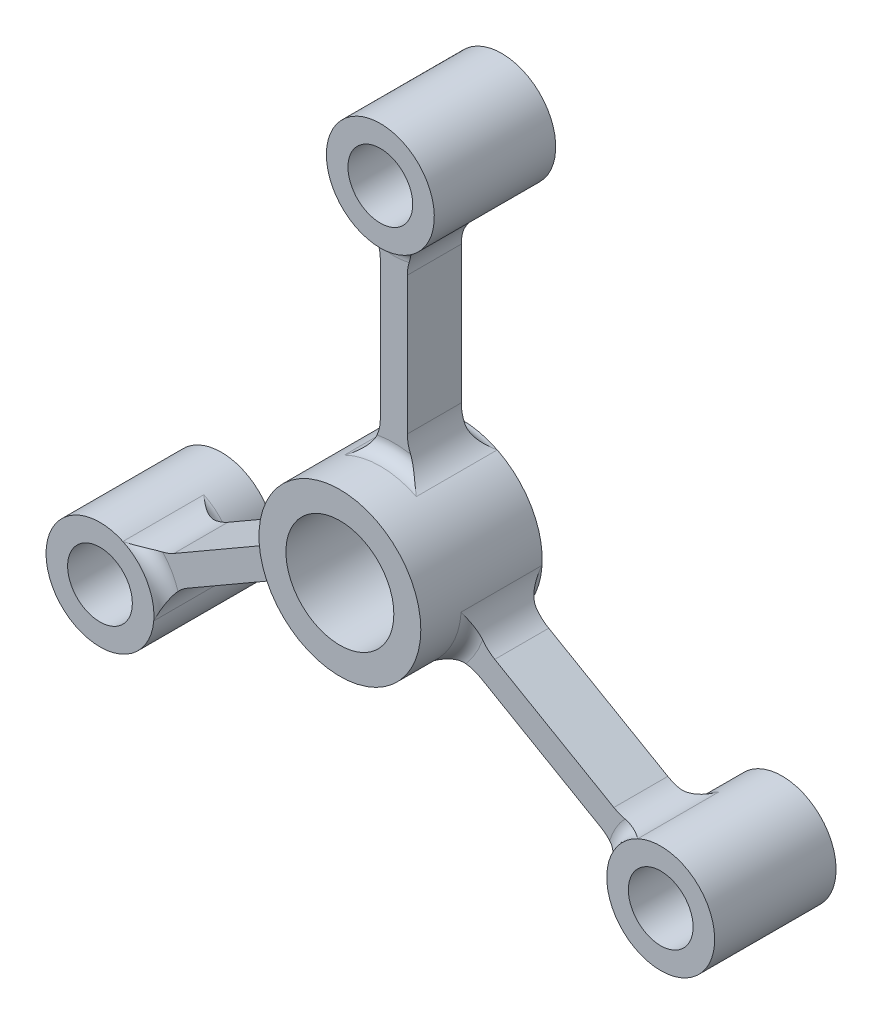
ISO-10303-21;
HEADER;
FILE_DESCRIPTION(('STEP AP214'),'2;1');
FILE_NAME('part.step','',(''),(''),'','','');
FILE_SCHEMA(('AUTOMOTIVE_DESIGN { 1 0 10303 214 1 1 1 1 }'));
ENDSEC;
DATA;
#1=APPLICATION_CONTEXT('core data for automotive mechanical design processes');
#2=APPLICATION_PROTOCOL_DEFINITION('international standard','automotive_design',2000,#1);
#3=PRODUCT_CONTEXT('',#1,'mechanical');
#4=PRODUCT('Part','Part','',(#3));
#5=PRODUCT_RELATED_PRODUCT_CATEGORY('part','',(#4));
#6=PRODUCT_DEFINITION_FORMATION('','',#4);
#7=PRODUCT_DEFINITION_CONTEXT('part definition',#1,'design');
#8=PRODUCT_DEFINITION('design','',#6,#7);
#9=PRODUCT_DEFINITION_SHAPE('','',#8);
#10=(LENGTH_UNIT() NAMED_UNIT(*) SI_UNIT(.MILLI.,.METRE.));
#11=(NAMED_UNIT(*) PLANE_ANGLE_UNIT() SI_UNIT($,.RADIAN.));
#12=(NAMED_UNIT(*) SI_UNIT($,.STERADIAN.) SOLID_ANGLE_UNIT());
#13=UNCERTAINTY_MEASURE_WITH_UNIT(LENGTH_MEASURE(1.E-05),#10,'distance_accuracy_value','');
#14=(GEOMETRIC_REPRESENTATION_CONTEXT(3) GLOBAL_UNCERTAINTY_ASSIGNED_CONTEXT((#13)) GLOBAL_UNIT_ASSIGNED_CONTEXT((#10,
#11,#12)) REPRESENTATION_CONTEXT('',''));
#15=CARTESIAN_POINT('',(0.,0.,0.));
#16=DIRECTION('',(0.,0.,1.));
#17=DIRECTION('',(1.,0.,0.));
#18=AXIS2_PLACEMENT_3D('',#15,#16,#17);
#19=CARTESIAN_POINT('',(0.,0.,0.));
#20=DIRECTION('',(0.,0.,1.));
#21=DIRECTION('',(1.,0.,0.));
#22=AXIS2_PLACEMENT_3D('',#19,#20,#21);
#23=PLANE('',#22);
#24=CARTESIAN_POINT('',(56.5457102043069,-17.9819841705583,0.));
#25=DIRECTION('',(0.,0.,1.));
#26=DIRECTION('',(1.,0.,0.));
#27=AXIS2_PLACEMENT_3D('',#24,#25,#26);
#28=CIRCLE('',#27,9.525);
#29=CARTESIAN_POINT('',(51.7832102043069,-26.2308761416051,0.));
#30=VERTEX_POINT('',#29);
#31=CARTESIAN_POINT('',(54.3928291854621,-27.2604931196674,0.));
#32=VERTEX_POINT('',#31);
#33=EDGE_CURVE('E607',#30,#32,#28,.T.);
#34=ORIENTED_EDGE('',*,*,#33,.T.);
#35=CARTESIAN_POINT('',(65.9911357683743,-38.0999999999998,0.));
#36=DIRECTION('',(0.,0.,1.));
#37=DIRECTION('',(1.,0.,0.));
#38=AXIS2_PLACEMENT_3D('',#35,#36,#37);
#39=CIRCLE('',#38,15.875);
#40=CARTESIAN_POINT('',(50.8046941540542,-33.4753252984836,0.));
#41=VERTEX_POINT('',#40);
#42=EDGE_CURVE('E576',#32,#41,#39,.T.);
#43=ORIENTED_EDGE('',*,*,#42,.T.);
#44=CARTESIAN_POINT('',(43.8457102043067,-39.9790294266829,0.));
#45=DIRECTION('',(0.,0.,1.));
#46=DIRECTION('',(1.,0.,0.));
#47=AXIS2_PLACEMENT_3D('',#44,#45,#46);
#48=CIRCLE('',#47,9.525);
#49=CARTESIAN_POINT('',(48.6082102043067,-31.7301374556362,0.));
#50=VERTEX_POINT('',#49);
#51=EDGE_CURVE('E611',#41,#50,#48,.T.);
#52=ORIENTED_EDGE('',*,*,#51,.T.);
#53=DIRECTION('',(0.86602540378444,-0.499999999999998,0.));
#54=VECTOR('',#53,1.);
#55=CARTESIAN_POINT('',(14.679534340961,-12.1414073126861,0.));
#56=LINE('',#55,#54);
#57=CARTESIAN_POINT('',(20.5807310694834,-15.5484648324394,0.));
#58=VERTEX_POINT('',#57);
#59=EDGE_CURVE('E648',#58,#50,#56,.T.);
#60=ORIENTED_EDGE('',*,*,#59,.F.);
#61=CARTESIAN_POINT('',(15.8182310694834,-23.7973568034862,0.));
#62=DIRECTION('',(0.,0.,1.));
#63=DIRECTION('',(1.,0.,0.));
#64=AXIS2_PLACEMENT_3D('',#61,#62,#63);
#65=CIRCLE('',#64,9.525);
#66=CARTESIAN_POINT('',(16.9771985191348,-14.3431292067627,0.));
#67=VERTEX_POINT('',#66);
#68=EDGE_CURVE('E705',#58,#67,#65,.T.);
#69=ORIENTED_EDGE('',*,*,#68,.T.);
#70=CARTESIAN_POINT('',(0.,0.,0.));
#71=DIRECTION('',(0.,0.,1.));
#72=DIRECTION('',(1.,0.,0.));
#73=AXIS2_PLACEMENT_3D('',#70,#71,#72);
#74=CIRCLE('',#73,22.225);
#75=CARTESIAN_POINT('',(20.9101135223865,-7.53112059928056,0.));
#76=VERTEX_POINT('',#75);
#77=EDGE_CURVE('E729',#67,#76,#74,.T.);
#78=ORIENTED_EDGE('',*,*,#77,.T.);
#79=CARTESIAN_POINT('',(28.5182310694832,-1.80031154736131,0.));
#80=DIRECTION('',(0.,0.,1.));
#81=DIRECTION('',(1.,0.,0.));
#82=AXIS2_PLACEMENT_3D('',#79,#80,#81);
#83=CIRCLE('',#82,9.525);
#84=CARTESIAN_POINT('',(23.7557310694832,-10.0492035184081,0.));
#85=VERTEX_POINT('',#84);
#86=EDGE_CURVE('E672',#76,#85,#83,.T.);
#87=ORIENTED_EDGE('',*,*,#86,.T.);
#88=DIRECTION('',(0.86602540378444,-0.499999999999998,0.));
#89=VECTOR('',#88,1.);
#90=CARTESIAN_POINT('',(17.854534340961,-6.64214599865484,0.));
#91=LINE('',#90,#89);
#92=EDGE_CURVE('E282',#85,#30,#91,.T.);
#93=ORIENTED_EDGE('',*,*,#92,.T.);
#94=EDGE_LOOP('',(#34,#43,#52,#60,#69,#78,#87,#93));
#95=FACE_BOUND('',#94,.T.);
#96=ADVANCED_FACE('F32',(#95),#23,.F.);
#97=CARTESIAN_POINT('',(-43.8457102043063,-39.9790294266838,0.));
#98=DIRECTION('',(0.,0.,1.));
#99=DIRECTION('',(1.,0.,0.));
#100=AXIS2_PLACEMENT_3D('',#97,#98,#99);
#101=CIRCLE('',#100,9.525);
#102=CARTESIAN_POINT('',(-48.6082102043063,-31.730137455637,0.));
#103=VERTEX_POINT('',#102);
#104=CARTESIAN_POINT('',(-50.8046941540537,-33.4753252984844,0.));
#105=VERTEX_POINT('',#104);
#106=EDGE_CURVE('E548',#103,#105,#101,.T.);
#107=ORIENTED_EDGE('',*,*,#106,.T.);
#108=CARTESIAN_POINT('',(-65.9911357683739,-38.1000000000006,0.));
#109=DIRECTION('',(0.,0.,1.));
#110=DIRECTION('',(1.,0.,0.));
#111=AXIS2_PLACEMENT_3D('',#108,#109,#110);
#112=CIRCLE('',#111,15.875);
#113=CARTESIAN_POINT('',(-54.3928291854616,-27.2604931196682,0.));
#114=VERTEX_POINT('',#113);
#115=EDGE_CURVE('E558',#105,#114,#112,.T.);
#116=ORIENTED_EDGE('',*,*,#115,.T.);
#117=CARTESIAN_POINT('',(-56.5457102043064,-17.9819841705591,0.));
#118=DIRECTION('',(0.,0.,1.));
#119=DIRECTION('',(1.,0.,0.));
#120=AXIS2_PLACEMENT_3D('',#117,#118,#119);
#121=CIRCLE('',#120,9.525);
#122=CARTESIAN_POINT('',(-51.7832102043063,-26.2308761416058,0.));
#123=VERTEX_POINT('',#122);
#124=EDGE_CURVE('E549',#114,#123,#121,.T.);
#125=ORIENTED_EDGE('',*,*,#124,.T.);
#126=DIRECTION('',(0.866025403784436,0.500000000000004,0.));
#127=VECTOR('',#126,1.);
#128=CARTESIAN_POINT('',(-56.9293620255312,-29.2020082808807,0.));
#129=LINE('',#128,#127);
#130=CARTESIAN_POINT('',(-23.7557310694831,-10.0492035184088,0.));
#131=VERTEX_POINT('',#130);
#132=EDGE_CURVE('E364',#123,#131,#129,.T.);
#133=ORIENTED_EDGE('',*,*,#132,.T.);
#134=CARTESIAN_POINT('',(-28.5182310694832,-1.80031154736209,0.));
#135=DIRECTION('',(0.,0.,1.));
#136=DIRECTION('',(1.,0.,0.));
#137=AXIS2_PLACEMENT_3D('',#134,#135,#136);
#138=CIRCLE('',#137,9.525);
#139=CARTESIAN_POINT('',(-20.9101135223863,-7.53112059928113,0.));
#140=VERTEX_POINT('',#139);
#141=EDGE_CURVE('E695',#131,#140,#138,.T.);
#142=ORIENTED_EDGE('',*,*,#141,.T.);
#143=CARTESIAN_POINT('',(0.,0.,0.));
#144=DIRECTION('',(0.,0.,1.));
#145=DIRECTION('',(1.,0.,0.));
#146=AXIS2_PLACEMENT_3D('',#143,#144,#145);
#147=CIRCLE('',#146,22.225);
#148=CARTESIAN_POINT('',(-16.9771985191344,-14.3431292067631,0.));
#149=VERTEX_POINT('',#148);
#150=EDGE_CURVE('E725',#140,#149,#147,.T.);
#151=ORIENTED_EDGE('',*,*,#150,.T.);
#152=CARTESIAN_POINT('',(-15.8182310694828,-23.7973568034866,0.));
#153=DIRECTION('',(0.,0.,1.));
#154=DIRECTION('',(1.,0.,0.));
#155=AXIS2_PLACEMENT_3D('',#152,#153,#154);
#156=CIRCLE('',#155,9.525);
#157=CARTESIAN_POINT('',(-20.5807310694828,-15.5484648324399,0.));
#158=VERTEX_POINT('',#157);
#159=EDGE_CURVE('E700',#149,#158,#156,.T.);
#160=ORIENTED_EDGE('',*,*,#159,.T.);
#161=DIRECTION('',(0.866025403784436,0.500000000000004,0.));
#162=VECTOR('',#161,1.);
#163=CARTESIAN_POINT('',(-53.7543620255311,-34.7012695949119,0.));
#164=LINE('',#163,#162);
#165=EDGE_CURVE('E347',#103,#158,#164,.T.);
#166=ORIENTED_EDGE('',*,*,#165,.F.);
#167=EDGE_LOOP('',(#107,#116,#125,#133,#142,#151,#160,#166));
#168=FACE_BOUND('',#167,.T.);
#169=ADVANCED_FACE('F510',(#168),#23,.F.);
#170=CARTESIAN_POINT('',(-12.7,57.9610135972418,0.));
#171=DIRECTION('',(0.,0.,1.));
#172=DIRECTION('',(1.,0.,0.));
#173=AXIS2_PLACEMENT_3D('',#170,#171,#172);
#174=CIRCLE('',#173,9.525);
#175=CARTESIAN_POINT('',(-3.17500000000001,57.9610135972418,0.));
#176=VERTEX_POINT('',#175);
#177=CARTESIAN_POINT('',(-3.58813503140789,60.7358184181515,0.));
#178=VERTEX_POINT('',#177);
#179=EDGE_CURVE('E600',#176,#178,#174,.T.);
#180=ORIENTED_EDGE('',*,*,#179,.T.);
#181=CARTESIAN_POINT('',(0.,76.2,0.));
#182=DIRECTION('',(0.,0.,1.));
#183=DIRECTION('',(1.,0.,0.));
#184=AXIS2_PLACEMENT_3D('',#181,#182,#183);
#185=CIRCLE('',#184,15.875);
#186=CARTESIAN_POINT('',(3.58813503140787,60.7358184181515,0.));
#187=VERTEX_POINT('',#186);
#188=EDGE_CURVE('E571',#178,#187,#185,.T.);
#189=ORIENTED_EDGE('',*,*,#188,.T.);
#190=CARTESIAN_POINT('',(12.7,57.9610135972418,0.));
#191=DIRECTION('',(0.,0.,1.));
#192=DIRECTION('',(1.,0.,0.));
#193=AXIS2_PLACEMENT_3D('',#190,#191,#192);
#194=CIRCLE('',#193,9.525);
#195=CARTESIAN_POINT('',(3.175,57.9610135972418,0.));
#196=VERTEX_POINT('',#195);
#197=EDGE_CURVE('E277',#187,#196,#194,.T.);
#198=ORIENTED_EDGE('',*,*,#197,.T.);
#199=DIRECTION('',(0.,-1.,0.));
#200=VECTOR('',#199,1.);
#201=CARTESIAN_POINT('',(3.175,63.9032778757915,0.));
#202=LINE('',#201,#200);
#203=CARTESIAN_POINT('',(3.17499999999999,25.5976683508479,0.));
#204=VERTEX_POINT('',#203);
#205=EDGE_CURVE('E270',#196,#204,#202,.T.);
#206=ORIENTED_EDGE('',*,*,#205,.T.);
#207=CARTESIAN_POINT('',(12.7,25.5976683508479,0.));
#208=DIRECTION('',(0.,0.,1.));
#209=DIRECTION('',(1.,0.,0.));
#210=AXIS2_PLACEMENT_3D('',#207,#208,#209);
#211=CIRCLE('',#210,9.525);
#212=CARTESIAN_POINT('',(3.9329150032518,21.8742498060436,0.));
#213=VERTEX_POINT('',#212);
#214=EDGE_CURVE('E274',#204,#213,#211,.T.);
#215=ORIENTED_EDGE('',*,*,#214,.T.);
#216=CARTESIAN_POINT('',(0.,0.,0.));
#217=DIRECTION('',(0.,0.,1.));
#218=DIRECTION('',(1.,0.,0.));
#219=AXIS2_PLACEMENT_3D('',#216,#217,#218);
#220=CIRCLE('',#219,22.225);
#221=CARTESIAN_POINT('',(-3.93291500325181,21.8742498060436,0.));
#222=VERTEX_POINT('',#221);
#223=EDGE_CURVE('E727',#213,#222,#220,.T.);
#224=ORIENTED_EDGE('',*,*,#223,.T.);
#225=CARTESIAN_POINT('',(-12.7,25.5976683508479,0.));
#226=DIRECTION('',(0.,0.,1.));
#227=DIRECTION('',(1.,0.,0.));
#228=AXIS2_PLACEMENT_3D('',#225,#226,#227);
#229=CIRCLE('',#228,9.525);
#230=CARTESIAN_POINT('',(-3.17499999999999,25.5976683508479,0.));
#231=VERTEX_POINT('',#230);
#232=EDGE_CURVE('E689',#222,#231,#229,.T.);
#233=ORIENTED_EDGE('',*,*,#232,.T.);
#234=DIRECTION('',(0.,-1.,0.));
#235=VECTOR('',#234,1.);
#236=CARTESIAN_POINT('',(-3.17500000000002,63.9032778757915,0.));
#237=LINE('',#236,#235);
#238=EDGE_CURVE('E281',#176,#231,#237,.T.);
#239=ORIENTED_EDGE('',*,*,#238,.F.);
#240=EDGE_LOOP('',(#180,#189,#198,#206,#215,#224,#233,#239));
#241=FACE_BOUND('',#240,.T.);
#242=ADVANCED_FACE('F273',(#241),#23,.F.);
#243=CARTESIAN_POINT('',(0.,0.,12.7));
#244=DIRECTION('',(0.,0.,1.));
#245=DIRECTION('',(1.,0.,0.));
#246=AXIS2_PLACEMENT_3D('',#243,#244,#245);
#247=PLANE('',#246);
#248=CARTESIAN_POINT('',(12.7,57.9610135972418,12.7));
#249=DIRECTION('',(0.,0.,1.));
#250=DIRECTION('',(1.,0.,0.));
#251=AXIS2_PLACEMENT_3D('',#248,#249,#250);
#252=CIRCLE('',#251,9.525);
#253=CARTESIAN_POINT('',(3.175,57.9610135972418,12.7));
#254=VERTEX_POINT('',#253);
#255=CARTESIAN_POINT('',(3.58813503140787,60.7358184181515,12.7));
#256=VERTEX_POINT('',#255);
#257=EDGE_CURVE('E605',#254,#256,#252,.F.);
#258=ORIENTED_EDGE('',*,*,#257,.T.);
#259=CARTESIAN_POINT('',(0.,76.2,12.7));
#260=DIRECTION('',(0.,0.,1.));
#261=DIRECTION('',(1.,0.,0.));
#262=AXIS2_PLACEMENT_3D('',#259,#260,#261);
#263=CIRCLE('',#262,15.875);
#264=CARTESIAN_POINT('',(-3.58813503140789,60.7358184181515,12.7));
#265=VERTEX_POINT('',#264);
#266=EDGE_CURVE('E569',#256,#265,#263,.F.);
#267=ORIENTED_EDGE('',*,*,#266,.T.);
#268=CARTESIAN_POINT('',(-12.7,57.9610135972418,12.7));
#269=DIRECTION('',(0.,0.,1.));
#270=DIRECTION('',(1.,0.,0.));
#271=AXIS2_PLACEMENT_3D('',#268,#269,#270);
#272=CIRCLE('',#271,9.525);
#273=CARTESIAN_POINT('',(-3.17500000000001,57.9610135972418,12.7));
#274=VERTEX_POINT('',#273);
#275=EDGE_CURVE('E602',#265,#274,#272,.F.);
#276=ORIENTED_EDGE('',*,*,#275,.T.);
#277=DIRECTION('',(0.,-1.,0.));
#278=VECTOR('',#277,1.);
#279=CARTESIAN_POINT('',(-3.17500000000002,63.9032778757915,12.7));
#280=LINE('',#279,#278);
#281=CARTESIAN_POINT('',(-3.17499999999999,25.5976683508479,12.7));
#282=VERTEX_POINT('',#281);
#283=EDGE_CURVE('E299',#274,#282,#280,.T.);
#284=ORIENTED_EDGE('',*,*,#283,.T.);
#285=CARTESIAN_POINT('',(-12.7,25.5976683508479,12.7));
#286=DIRECTION('',(0.,0.,1.));
#287=DIRECTION('',(1.,0.,0.));
#288=AXIS2_PLACEMENT_3D('',#285,#286,#287);
#289=CIRCLE('',#288,9.525);
#290=CARTESIAN_POINT('',(-3.93291500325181,21.8742498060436,12.7));
#291=VERTEX_POINT('',#290);
#292=EDGE_CURVE('E692',#282,#291,#289,.F.);
#293=ORIENTED_EDGE('',*,*,#292,.T.);
#294=CARTESIAN_POINT('',(0.,0.,12.7));
#295=DIRECTION('',(0.,0.,1.));
#296=DIRECTION('',(1.,0.,0.));
#297=AXIS2_PLACEMENT_3D('',#294,#295,#296);
#298=CIRCLE('',#297,22.225);
#299=CARTESIAN_POINT('',(3.9329150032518,21.8742498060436,12.7));
#300=VERTEX_POINT('',#299);
#301=EDGE_CURVE('E723',#291,#300,#298,.F.);
#302=ORIENTED_EDGE('',*,*,#301,.T.);
#303=CARTESIAN_POINT('',(12.7,25.5976683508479,12.7));
#304=DIRECTION('',(0.,0.,1.));
#305=DIRECTION('',(1.,0.,0.));
#306=AXIS2_PLACEMENT_3D('',#303,#304,#305);
#307=CIRCLE('',#306,9.525);
#308=CARTESIAN_POINT('',(3.17499999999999,25.5976683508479,12.7));
#309=VERTEX_POINT('',#308);
#310=EDGE_CURVE('E291',#300,#309,#307,.F.);
#311=ORIENTED_EDGE('',*,*,#310,.T.);
#312=DIRECTION('',(0.,-1.,0.));
#313=VECTOR('',#312,1.);
#314=CARTESIAN_POINT('',(3.175,63.9032778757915,12.7));
#315=LINE('',#314,#313);
#316=EDGE_CURVE('E296',#254,#309,#315,.T.);
#317=ORIENTED_EDGE('',*,*,#316,.F.);
#318=EDGE_LOOP('',(#258,#267,#276,#284,#293,#302,#311,#317));
#319=FACE_BOUND('',#318,.T.);
#320=ADVANCED_FACE('F521',(#319),#247,.T.);
#321=CARTESIAN_POINT('',(43.8457102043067,-39.9790294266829,12.7));
#322=DIRECTION('',(0.,0.,1.));
#323=DIRECTION('',(1.,0.,0.));
#324=AXIS2_PLACEMENT_3D('',#321,#322,#323);
#325=CIRCLE('',#324,9.525);
#326=CARTESIAN_POINT('',(48.6082102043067,-31.7301374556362,12.7));
#327=VERTEX_POINT('',#326);
#328=CARTESIAN_POINT('',(50.8046941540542,-33.4753252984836,12.7));
#329=VERTEX_POINT('',#328);
#330=EDGE_CURVE('E563',#327,#329,#325,.F.);
#331=ORIENTED_EDGE('',*,*,#330,.T.);
#332=CARTESIAN_POINT('',(65.9911357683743,-38.0999999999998,12.7));
#333=DIRECTION('',(0.,0.,1.));
#334=DIRECTION('',(1.,0.,0.));
#335=AXIS2_PLACEMENT_3D('',#332,#333,#334);
#336=CIRCLE('',#335,15.875);
#337=CARTESIAN_POINT('',(54.3928291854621,-27.2604931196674,12.7));
#338=VERTEX_POINT('',#337);
#339=EDGE_CURVE('E52',#329,#338,#336,.F.);
#340=ORIENTED_EDGE('',*,*,#339,.T.);
#341=CARTESIAN_POINT('',(56.5457102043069,-17.9819841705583,12.7));
#342=DIRECTION('',(0.,0.,1.));
#343=DIRECTION('',(1.,0.,0.));
#344=AXIS2_PLACEMENT_3D('',#341,#342,#343);
#345=CIRCLE('',#344,9.525);
#346=CARTESIAN_POINT('',(51.7832102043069,-26.2308761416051,12.7));
#347=VERTEX_POINT('',#346);
#348=EDGE_CURVE('E609',#338,#347,#345,.F.);
#349=ORIENTED_EDGE('',*,*,#348,.T.);
#350=DIRECTION('',(0.86602540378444,-0.499999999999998,0.));
#351=VECTOR('',#350,1.);
#352=CARTESIAN_POINT('',(17.854534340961,-6.64214599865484,12.7));
#353=LINE('',#352,#351);
#354=CARTESIAN_POINT('',(23.7557310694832,-10.0492035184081,12.7));
#355=VERTEX_POINT('',#354);
#356=EDGE_CURVE('E331',#355,#347,#353,.T.);
#357=ORIENTED_EDGE('',*,*,#356,.F.);
#358=CARTESIAN_POINT('',(28.5182310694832,-1.80031154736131,12.7));
#359=DIRECTION('',(0.,0.,1.));
#360=DIRECTION('',(1.,0.,0.));
#361=AXIS2_PLACEMENT_3D('',#358,#359,#360);
#362=CIRCLE('',#361,9.525);
#363=CARTESIAN_POINT('',(20.9101135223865,-7.53112059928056,12.7));
#364=VERTEX_POINT('',#363);
#365=EDGE_CURVE('E684',#355,#364,#362,.F.);
#366=ORIENTED_EDGE('',*,*,#365,.T.);
#367=CARTESIAN_POINT('',(0.,0.,12.7));
#368=DIRECTION('',(0.,0.,1.));
#369=DIRECTION('',(1.,0.,0.));
#370=AXIS2_PLACEMENT_3D('',#367,#368,#369);
#371=CIRCLE('',#370,22.225);
#372=CARTESIAN_POINT('',(16.9771985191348,-14.3431292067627,12.7));
#373=VERTEX_POINT('',#372);
#374=EDGE_CURVE('E731',#364,#373,#371,.F.);
#375=ORIENTED_EDGE('',*,*,#374,.T.);
#376=CARTESIAN_POINT('',(15.8182310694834,-23.7973568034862,12.7));
#377=DIRECTION('',(0.,0.,1.));
#378=DIRECTION('',(1.,0.,0.));
#379=AXIS2_PLACEMENT_3D('',#376,#377,#378);
#380=CIRCLE('',#379,9.525);
#381=CARTESIAN_POINT('',(20.5807310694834,-15.5484648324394,12.7));
#382=VERTEX_POINT('',#381);
#383=EDGE_CURVE('E708',#373,#382,#380,.F.);
#384=ORIENTED_EDGE('',*,*,#383,.T.);
#385=DIRECTION('',(0.86602540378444,-0.499999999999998,0.));
#386=VECTOR('',#385,1.);
#387=CARTESIAN_POINT('',(14.679534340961,-12.1414073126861,12.7));
#388=LINE('',#387,#386);
#389=EDGE_CURVE('E327',#382,#327,#388,.T.);
#390=ORIENTED_EDGE('',*,*,#389,.T.);
#391=EDGE_LOOP('',(#331,#340,#349,#357,#366,#375,#384,#390));
#392=FACE_BOUND('',#391,.T.);
#393=ADVANCED_FACE('F525',(#392),#247,.T.);
#394=CARTESIAN_POINT('',(-56.5457102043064,-17.9819841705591,12.7));
#395=DIRECTION('',(0.,0.,1.));
#396=DIRECTION('',(1.,0.,0.));
#397=AXIS2_PLACEMENT_3D('',#394,#395,#396);
#398=CIRCLE('',#397,9.525);
#399=CARTESIAN_POINT('',(-51.7832102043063,-26.2308761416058,12.7));
#400=VERTEX_POINT('',#399);
#401=CARTESIAN_POINT('',(-54.3928291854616,-27.2604931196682,12.7));
#402=VERTEX_POINT('',#401);
#403=EDGE_CURVE('E543',#400,#402,#398,.F.);
#404=ORIENTED_EDGE('',*,*,#403,.T.);
#405=CARTESIAN_POINT('',(-65.9911357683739,-38.1000000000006,12.7));
#406=DIRECTION('',(0.,0.,1.));
#407=DIRECTION('',(1.,0.,0.));
#408=AXIS2_PLACEMENT_3D('',#405,#406,#407);
#409=CIRCLE('',#408,15.875);
#410=CARTESIAN_POINT('',(-50.8046941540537,-33.4753252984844,12.7));
#411=VERTEX_POINT('',#410);
#412=EDGE_CURVE('E545',#402,#411,#409,.F.);
#413=ORIENTED_EDGE('',*,*,#412,.T.);
#414=CARTESIAN_POINT('',(-43.8457102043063,-39.9790294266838,12.7));
#415=DIRECTION('',(0.,0.,1.));
#416=DIRECTION('',(1.,0.,0.));
#417=AXIS2_PLACEMENT_3D('',#414,#415,#416);
#418=CIRCLE('',#417,9.525);
#419=CARTESIAN_POINT('',(-48.6082102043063,-31.730137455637,12.7));
#420=VERTEX_POINT('',#419);
#421=EDGE_CURVE('E590',#411,#420,#418,.F.);
#422=ORIENTED_EDGE('',*,*,#421,.T.);
#423=DIRECTION('',(0.866025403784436,0.500000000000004,0.));
#424=VECTOR('',#423,1.);
#425=CARTESIAN_POINT('',(-53.7543620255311,-34.7012695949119,12.7));
#426=LINE('',#425,#424);
#427=CARTESIAN_POINT('',(-20.5807310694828,-15.5484648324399,12.7));
#428=VERTEX_POINT('',#427);
#429=EDGE_CURVE('E332',#420,#428,#426,.T.);
#430=ORIENTED_EDGE('',*,*,#429,.T.);
#431=CARTESIAN_POINT('',(-15.8182310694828,-23.7973568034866,12.7));
#432=DIRECTION('',(0.,0.,1.));
#433=DIRECTION('',(1.,0.,0.));
#434=AXIS2_PLACEMENT_3D('',#431,#432,#433);
#435=CIRCLE('',#434,9.525);
#436=CARTESIAN_POINT('',(-16.9771985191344,-14.3431292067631,12.7));
#437=VERTEX_POINT('',#436);
#438=EDGE_CURVE('E702',#428,#437,#435,.F.);
#439=ORIENTED_EDGE('',*,*,#438,.T.);
#440=CARTESIAN_POINT('',(0.,0.,12.7));
#441=DIRECTION('',(0.,0.,1.));
#442=DIRECTION('',(1.,0.,0.));
#443=AXIS2_PLACEMENT_3D('',#440,#441,#442);
#444=CIRCLE('',#443,22.225);
#445=CARTESIAN_POINT('',(-20.9101135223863,-7.53112059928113,12.7));
#446=VERTEX_POINT('',#445);
#447=EDGE_CURVE('E721',#437,#446,#444,.F.);
#448=ORIENTED_EDGE('',*,*,#447,.T.);
#449=CARTESIAN_POINT('',(-28.5182310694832,-1.80031154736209,12.7));
#450=DIRECTION('',(0.,0.,1.));
#451=DIRECTION('',(1.,0.,0.));
#452=AXIS2_PLACEMENT_3D('',#449,#450,#451);
#453=CIRCLE('',#452,9.525);
#454=CARTESIAN_POINT('',(-23.7557310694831,-10.0492035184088,12.7));
#455=VERTEX_POINT('',#454);
#456=EDGE_CURVE('E698',#446,#455,#453,.F.);
#457=ORIENTED_EDGE('',*,*,#456,.T.);
#458=DIRECTION('',(0.866025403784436,0.500000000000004,0.));
#459=VECTOR('',#458,1.);
#460=CARTESIAN_POINT('',(-56.9293620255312,-29.2020082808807,12.7));
#461=LINE('',#460,#459);
#462=EDGE_CURVE('E346',#400,#455,#461,.T.);
#463=ORIENTED_EDGE('',*,*,#462,.F.);
#464=EDGE_LOOP('',(#404,#413,#422,#430,#439,#448,#457,#463));
#465=FACE_BOUND('',#464,.T.);
#466=ADVANCED_FACE('F527',(#465),#247,.T.);
#467=CARTESIAN_POINT('',(-56.9293620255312,-29.2020082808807,12.7));
#468=DIRECTION('',(-0.500000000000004,0.866025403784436,0.));
#469=DIRECTION('',(-0.866025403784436,-0.500000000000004,0.));
#470=AXIS2_PLACEMENT_3D('',#467,#468,#469);
#471=PLANE('',#470);
#472=ORIENTED_EDGE('',*,*,#132,.F.);
#473=DIRECTION('',(0.,0.,-1.));
#474=VECTOR('',#473,1.);
#475=CARTESIAN_POINT('',(-51.7832102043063,-26.2308761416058,12.7));
#476=LINE('',#475,#474);
#477=EDGE_CURVE('E353',#123,#400,#476,.F.);
#478=ORIENTED_EDGE('',*,*,#477,.T.);
#479=ORIENTED_EDGE('',*,*,#462,.T.);
#480=DIRECTION('',(0.,0.,-1.));
#481=VECTOR('',#480,1.);
#482=CARTESIAN_POINT('',(-23.7557310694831,-10.0492035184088,12.7));
#483=LINE('',#482,#481);
#484=EDGE_CURVE('E320',#455,#131,#483,.T.);
#485=ORIENTED_EDGE('',*,*,#484,.T.);
#486=EDGE_LOOP('',(#472,#478,#479,#485));
#487=FACE_BOUND('',#486,.T.);
#488=ADVANCED_FACE('F534',(#487),#471,.T.);
#489=CARTESIAN_POINT('',(-65.9911357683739,-38.1000000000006,12.7));
#490=DIRECTION('',(0.,0.,-1.));
#491=DIRECTION('',(-1.,0.,0.));
#492=AXIS2_PLACEMENT_3D('',#489,#490,#491);
#493=CYLINDRICAL_SURFACE('',#492,12.7);
#494=CARTESIAN_POINT('',(-65.9911357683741,-38.1000000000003,15.875));
#495=DIRECTION('',(0.,0.,1.));
#496=DIRECTION('',(1.,0.,0.));
#497=AXIS2_PLACEMENT_3D('',#494,#495,#496);
#498=CIRCLE('',#497,12.7);
#499=CARTESIAN_POINT('',(-60.5937497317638,-26.6039909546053,15.875));
#500=VERTEX_POINT('',#499);
#501=CARTESIAN_POINT('',(-53.3366068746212,-39.1737311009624,15.875));
#502=VERTEX_POINT('',#501);
#503=EDGE_CURVE('E635',#500,#502,#498,.T.);
#504=ORIENTED_EDGE('',*,*,#503,.F.);
#505=DIRECTION('',(0.,0.,-1.));
#506=VECTOR('',#505,1.);
#507=CARTESIAN_POINT('',(-60.5937497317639,-26.6039909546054,12.7));
#508=LINE('',#507,#506);
#509=CARTESIAN_POINT('',(-60.5937497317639,-26.6039909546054,-3.175));
#510=VERTEX_POINT('',#509);
#511=EDGE_CURVE('E368',#500,#510,#508,.T.);
#512=ORIENTED_EDGE('',*,*,#511,.T.);
#513=CARTESIAN_POINT('',(-65.9911357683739,-38.1000000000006,-3.175));
#514=DIRECTION('',(0.,0.,1.));
#515=DIRECTION('',(1.,0.,0.));
#516=AXIS2_PLACEMENT_3D('',#513,#514,#515);
#517=CIRCLE('',#516,12.7);
#518=CARTESIAN_POINT('',(-53.336606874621,-39.1737311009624,-3.175));
#519=VERTEX_POINT('',#518);
#520=EDGE_CURVE('E559',#510,#519,#517,.F.);
#521=ORIENTED_EDGE('',*,*,#520,.T.);
#522=DIRECTION('',(0.,0.,-1.));
#523=VECTOR('',#522,1.);
#524=CARTESIAN_POINT('',(-53.336606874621,-39.1737311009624,12.7));
#525=LINE('',#524,#523);
#526=EDGE_CURVE('E373',#519,#502,#525,.F.);
#527=ORIENTED_EDGE('',*,*,#526,.T.);
#528=EDGE_LOOP('',(#504,#512,#521,#527));
#529=FACE_BOUND('',#528,.T.);
#530=CARTESIAN_POINT('',(-65.9911357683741,-38.1000000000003,-12.7));
#531=DIRECTION('',(0.,0.,-1.));
#532=DIRECTION('',(-1.,0.,0.));
#533=AXIS2_PLACEMENT_3D('',#530,#531,#532);
#534=CIRCLE('',#533,12.7);
#535=CARTESIAN_POINT('',(-78.6911357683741,-38.1000000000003,-12.7));
#536=VERTEX_POINT('',#535);
#537=EDGE_CURVE('E643',#536,#536,#534,.T.);
#538=ORIENTED_EDGE('',*,*,#537,.F.);
#539=EDGE_LOOP('',(#538));
#540=FACE_BOUND('',#539,.T.);
#541=ADVANCED_FACE('F539',(#529,#540),#493,.T.);
#542=CARTESIAN_POINT('',(-53.7543620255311,-34.7012695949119,12.7));
#543=DIRECTION('',(-0.500000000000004,0.866025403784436,0.));
#544=DIRECTION('',(-0.866025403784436,-0.500000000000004,0.));
#545=AXIS2_PLACEMENT_3D('',#542,#543,#544);
#546=PLANE('',#545);
#547=ORIENTED_EDGE('',*,*,#429,.F.);
#548=DIRECTION('',(0.,0.,1.));
#549=VECTOR('',#548,1.);
#550=CARTESIAN_POINT('',(-48.6082102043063,-31.730137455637,0.));
#551=LINE('',#550,#549);
#552=EDGE_CURVE('E350',#420,#103,#551,.F.);
#553=ORIENTED_EDGE('',*,*,#552,.T.);
#554=ORIENTED_EDGE('',*,*,#165,.T.);
#555=DIRECTION('',(0.,0.,1.));
#556=VECTOR('',#555,1.);
#557=CARTESIAN_POINT('',(-20.5807310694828,-15.5484648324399,12.7));
#558=LINE('',#557,#556);
#559=EDGE_CURVE('E323',#158,#428,#558,.T.);
#560=ORIENTED_EDGE('',*,*,#559,.T.);
#561=EDGE_LOOP('',(#547,#553,#554,#560));
#562=FACE_BOUND('',#561,.T.);
#563=ADVANCED_FACE('F926',(#562),#546,.F.);
#564=CARTESIAN_POINT('',(14.679534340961,-12.1414073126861,12.7));
#565=DIRECTION('',(0.499999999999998,0.86602540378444,0.));
#566=DIRECTION('',(-0.86602540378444,0.499999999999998,0.));
#567=AXIS2_PLACEMENT_3D('',#564,#565,#566);
#568=PLANE('',#567);
#569=ORIENTED_EDGE('',*,*,#59,.T.);
#570=DIRECTION('',(0.,0.,1.));
#571=VECTOR('',#570,1.);
#572=CARTESIAN_POINT('',(48.6082102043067,-31.7301374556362,12.7));
#573=LINE('',#572,#571);
#574=EDGE_CURVE('E593',#50,#327,#573,.T.);
#575=ORIENTED_EDGE('',*,*,#574,.T.);
#576=ORIENTED_EDGE('',*,*,#389,.F.);
#577=DIRECTION('',(0.,0.,1.));
#578=VECTOR('',#577,1.);
#579=CARTESIAN_POINT('',(20.5807310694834,-15.5484648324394,0.));
#580=LINE('',#579,#578);
#581=EDGE_CURVE('E326',#382,#58,#580,.F.);
#582=ORIENTED_EDGE('',*,*,#581,.T.);
#583=EDGE_LOOP('',(#569,#575,#576,#582));
#584=FACE_BOUND('',#583,.T.);
#585=ADVANCED_FACE('F923',(#584),#568,.F.);
#586=CARTESIAN_POINT('',(65.9911357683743,-38.0999999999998,12.7));
#587=DIRECTION('',(0.,0.,-1.));
#588=DIRECTION('',(-1.,0.,0.));
#589=AXIS2_PLACEMENT_3D('',#586,#587,#588);
#590=CYLINDRICAL_SURFACE('',#589,12.7);
#591=CARTESIAN_POINT('',(65.9911357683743,-38.0999999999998,-3.175));
#592=DIRECTION('',(0.,0.,1.));
#593=DIRECTION('',(1.,0.,0.));
#594=AXIS2_PLACEMENT_3D('',#591,#592,#593);
#595=CIRCLE('',#594,12.7);
#596=CARTESIAN_POINT('',(53.3366068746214,-39.1737311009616,-3.175));
#597=VERTEX_POINT('',#596);
#598=CARTESIAN_POINT('',(60.5937497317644,-26.6039909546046,-3.175));
#599=VERTEX_POINT('',#598);
#600=EDGE_CURVE('E573',#597,#599,#595,.F.);
#601=ORIENTED_EDGE('',*,*,#600,.T.);
#602=DIRECTION('',(0.,0.,-1.));
#603=VECTOR('',#602,1.);
#604=CARTESIAN_POINT('',(60.5937497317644,-26.6039909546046,12.7));
#605=LINE('',#604,#603);
#606=CARTESIAN_POINT('',(60.5937497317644,-26.6039909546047,15.875));
#607=VERTEX_POINT('',#606);
#608=EDGE_CURVE('E595',#599,#607,#605,.F.);
#609=ORIENTED_EDGE('',*,*,#608,.T.);
#610=CARTESIAN_POINT('',(65.9911357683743,-38.0999999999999,15.875));
#611=DIRECTION('',(0.,0.,1.));
#612=DIRECTION('',(1.,0.,0.));
#613=AXIS2_PLACEMENT_3D('',#610,#611,#612);
#614=CIRCLE('',#613,12.7);
#615=CARTESIAN_POINT('',(53.3366068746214,-39.1737311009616,15.875));
#616=VERTEX_POINT('',#615);
#617=EDGE_CURVE('E624',#616,#607,#614,.T.);
#618=ORIENTED_EDGE('',*,*,#617,.F.);
#619=DIRECTION('',(0.,0.,-1.));
#620=VECTOR('',#619,1.);
#621=CARTESIAN_POINT('',(53.3366068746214,-39.1737311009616,12.7));
#622=LINE('',#621,#620);
#623=EDGE_CURVE('E663',#616,#597,#622,.T.);
#624=ORIENTED_EDGE('',*,*,#623,.T.);
#625=EDGE_LOOP('',(#601,#609,#618,#624));
#626=FACE_BOUND('',#625,.T.);
#627=CARTESIAN_POINT('',(65.9911357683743,-38.0999999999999,-12.7));
#628=DIRECTION('',(0.,0.,-1.));
#629=DIRECTION('',(-1.,0.,0.));
#630=AXIS2_PLACEMENT_3D('',#627,#628,#629);
#631=CIRCLE('',#630,12.7);
#632=CARTESIAN_POINT('',(53.2911357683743,-38.0999999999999,-12.7));
#633=VERTEX_POINT('',#632);
#634=EDGE_CURVE('E640',#633,#633,#631,.T.);
#635=ORIENTED_EDGE('',*,*,#634,.F.);
#636=EDGE_LOOP('',(#635));
#637=FACE_BOUND('',#636,.T.);
#638=ADVANCED_FACE('F664',(#626,#637),#590,.T.);
#639=CARTESIAN_POINT('',(17.854534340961,-6.64214599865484,12.7));
#640=DIRECTION('',(0.499999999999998,0.86602540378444,0.));
#641=DIRECTION('',(-0.86602540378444,0.499999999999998,0.));
#642=AXIS2_PLACEMENT_3D('',#639,#640,#641);
#643=PLANE('',#642);
#644=ORIENTED_EDGE('',*,*,#356,.T.);
#645=DIRECTION('',(0.,0.,-1.));
#646=VECTOR('',#645,1.);
#647=CARTESIAN_POINT('',(51.7832102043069,-26.2308761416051,12.7));
#648=LINE('',#647,#646);
#649=EDGE_CURVE('E660',#347,#30,#648,.T.);
#650=ORIENTED_EDGE('',*,*,#649,.T.);
#651=ORIENTED_EDGE('',*,*,#92,.F.);
#652=DIRECTION('',(0.,0.,-1.));
#653=VECTOR('',#652,1.);
#654=CARTESIAN_POINT('',(23.7557310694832,-10.0492035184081,12.7));
#655=LINE('',#654,#653);
#656=EDGE_CURVE('E292',#85,#355,#655,.F.);
#657=ORIENTED_EDGE('',*,*,#656,.T.);
#658=EDGE_LOOP('',(#644,#650,#651,#657));
#659=FACE_BOUND('',#658,.T.);
#660=ADVANCED_FACE('F676',(#659),#643,.T.);
#661=CARTESIAN_POINT('',(0.,0.,12.7));
#662=DIRECTION('',(0.,0.,-1.));
#663=DIRECTION('',(-1.,0.,0.));
#664=AXIS2_PLACEMENT_3D('',#661,#662,#663);
#665=CYLINDRICAL_SURFACE('',#664,19.05);
#666=CARTESIAN_POINT('',(0.,0.,15.875));
#667=DIRECTION('',(0.,0.,1.));
#668=DIRECTION('',(1.,0.,0.));
#669=AXIS2_PLACEMENT_3D('',#666,#667,#668);
#670=CIRCLE('',#669,19.05);
#671=CARTESIAN_POINT('',(-19.0121540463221,-1.20020769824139,15.875));
#672=VERTEX_POINT('',#671);
#673=CARTESIAN_POINT('',(-10.5454873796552,-15.8649045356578,15.875));
#674=VERTEX_POINT('',#673);
#675=EDGE_CURVE('E718',#672,#674,#670,.T.);
#676=ORIENTED_EDGE('',*,*,#675,.T.);
#677=DIRECTION('',(0.,0.,-1.));
#678=VECTOR('',#677,1.);
#679=CARTESIAN_POINT('',(-10.5454873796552,-15.8649045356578,12.7));
#680=LINE('',#679,#678);
#681=CARTESIAN_POINT('',(-10.5454873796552,-15.8649045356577,-3.175));
#682=VERTEX_POINT('',#681);
#683=EDGE_CURVE('E309',#674,#682,#680,.T.);
#684=ORIENTED_EDGE('',*,*,#683,.T.);
#685=CARTESIAN_POINT('',(0.,0.,-3.175));
#686=DIRECTION('',(0.,0.,-1.));
#687=DIRECTION('',(-1.,0.,0.));
#688=AXIS2_PLACEMENT_3D('',#685,#686,#687);
#689=CIRCLE('',#688,19.05);
#690=CARTESIAN_POINT('',(10.5454873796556,-15.8649045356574,-3.175));
#691=VERTEX_POINT('',#690);
#692=EDGE_CURVE('E834',#691,#682,#689,.T.);
#693=ORIENTED_EDGE('',*,*,#692,.F.);
#694=DIRECTION('',(0.,0.,-1.));
#695=VECTOR('',#694,1.);
#696=CARTESIAN_POINT('',(10.5454873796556,-15.8649045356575,12.7));
#697=LINE('',#696,#695);
#698=CARTESIAN_POINT('',(10.5454873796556,-15.8649045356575,15.875));
#699=VERTEX_POINT('',#698);
#700=EDGE_CURVE('E301',#691,#699,#697,.F.);
#701=ORIENTED_EDGE('',*,*,#700,.T.);
#702=CARTESIAN_POINT('',(0.,0.,15.875));
#703=DIRECTION('',(0.,0.,1.));
#704=DIRECTION('',(1.,0.,0.));
#705=AXIS2_PLACEMENT_3D('',#702,#703,#704);
#706=CIRCLE('',#705,19.05);
#707=CARTESIAN_POINT('',(19.0121540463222,-1.20020769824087,15.875));
#708=VERTEX_POINT('',#707);
#709=EDGE_CURVE('E712',#699,#708,#706,.T.);
#710=ORIENTED_EDGE('',*,*,#709,.T.);
#711=DIRECTION('',(0.,0.,-1.));
#712=VECTOR('',#711,1.);
#713=CARTESIAN_POINT('',(19.0121540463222,-1.20020769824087,12.7));
#714=LINE('',#713,#712);
#715=CARTESIAN_POINT('',(19.0121540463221,-1.20020769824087,-3.175));
#716=VERTEX_POINT('',#715);
#717=EDGE_CURVE('E298',#708,#716,#714,.T.);
#718=ORIENTED_EDGE('',*,*,#717,.T.);
#719=CARTESIAN_POINT('',(8.46666666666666,17.0651122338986,-3.175));
#720=VERTEX_POINT('',#719);
#721=EDGE_CURVE('E843',#720,#716,#689,.T.);
#722=ORIENTED_EDGE('',*,*,#721,.F.);
#723=DIRECTION('',(0.,0.,-1.));
#724=VECTOR('',#723,1.);
#725=CARTESIAN_POINT('',(8.46666666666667,17.0651122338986,12.7));
#726=LINE('',#725,#724);
#727=CARTESIAN_POINT('',(8.46666666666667,17.0651122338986,15.875));
#728=VERTEX_POINT('',#727);
#729=EDGE_CURVE('E315',#720,#728,#726,.F.);
#730=ORIENTED_EDGE('',*,*,#729,.T.);
#731=CARTESIAN_POINT('',(0.,0.,15.875));
#732=DIRECTION('',(0.,0.,1.));
#733=DIRECTION('',(1.,0.,0.));
#734=AXIS2_PLACEMENT_3D('',#731,#732,#733);
#735=CIRCLE('',#734,19.05);
#736=CARTESIAN_POINT('',(-8.46666666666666,17.0651122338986,15.875));
#737=VERTEX_POINT('',#736);
#738=EDGE_CURVE('E715',#728,#737,#735,.T.);
#739=ORIENTED_EDGE('',*,*,#738,.T.);
#740=DIRECTION('',(0.,0.,-1.));
#741=VECTOR('',#740,1.);
#742=CARTESIAN_POINT('',(-8.46666666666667,17.0651122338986,12.7));
#743=LINE('',#742,#741);
#744=CARTESIAN_POINT('',(-8.46666666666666,17.0651122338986,-3.175));
#745=VERTEX_POINT('',#744);
#746=EDGE_CURVE('E313',#737,#745,#743,.T.);
#747=ORIENTED_EDGE('',*,*,#746,.T.);
#748=CARTESIAN_POINT('',(-19.0121540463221,-1.20020769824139,-3.175));
#749=VERTEX_POINT('',#748);
#750=EDGE_CURVE('E844',#749,#745,#689,.T.);
#751=ORIENTED_EDGE('',*,*,#750,.F.);
#752=DIRECTION('',(0.,0.,-1.));
#753=VECTOR('',#752,1.);
#754=CARTESIAN_POINT('',(-19.0121540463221,-1.20020769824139,12.7));
#755=LINE('',#754,#753);
#756=EDGE_CURVE('E311',#749,#672,#755,.F.);
#757=ORIENTED_EDGE('',*,*,#756,.T.);
#758=EDGE_LOOP('',(#676,#684,#693,#701,#710,#718,#722,#730,#739,#747,#751,#757));
#759=FACE_BOUND('',#758,.T.);
#760=CARTESIAN_POINT('',(0.,0.,25.4));
#761=DIRECTION('',(0.,0.,1.));
#762=DIRECTION('',(1.,0.,0.));
#763=AXIS2_PLACEMENT_3D('',#760,#761,#762);
#764=CIRCLE('',#763,19.0500000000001);
#765=CARTESIAN_POINT('',(19.0500000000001,0.,25.4));
#766=VERTEX_POINT('',#765);
#767=EDGE_CURVE('E366',#766,#766,#764,.T.);
#768=ORIENTED_EDGE('',*,*,#767,.F.);
#769=EDGE_LOOP('',(#768));
#770=FACE_BOUND('',#769,.T.);
#771=ADVANCED_FACE('F910',(#759,#770),#665,.T.);
#772=CARTESIAN_POINT('',(3.175,63.9032778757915,12.7));
#773=DIRECTION('',(1.,0.,0.));
#774=DIRECTION('',(0.,1.,0.));
#775=AXIS2_PLACEMENT_3D('',#772,#773,#774);
#776=PLANE('',#775);
#777=ORIENTED_EDGE('',*,*,#205,.F.);
#778=DIRECTION('',(0.,0.,-1.));
#779=VECTOR('',#778,1.);
#780=CARTESIAN_POINT('',(3.175,57.9610135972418,12.7));
#781=LINE('',#780,#779);
#782=EDGE_CURVE('E658',#196,#254,#781,.F.);
#783=ORIENTED_EDGE('',*,*,#782,.T.);
#784=ORIENTED_EDGE('',*,*,#316,.T.);
#785=DIRECTION('',(0.,0.,-1.));
#786=VECTOR('',#785,1.);
#787=CARTESIAN_POINT('',(3.17499999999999,25.5976683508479,12.7));
#788=LINE('',#787,#786);
#789=EDGE_CURVE('E288',#309,#204,#788,.T.);
#790=ORIENTED_EDGE('',*,*,#789,.T.);
#791=EDGE_LOOP('',(#777,#783,#784,#790));
#792=FACE_BOUND('',#791,.T.);
#793=ADVANCED_FACE('F294',(#792),#776,.T.);
#794=CARTESIAN_POINT('',(0.,76.2,12.7));
#795=DIRECTION('',(0.,0.,-1.));
#796=DIRECTION('',(-1.,0.,0.));
#797=AXIS2_PLACEMENT_3D('',#794,#795,#796);
#798=CYLINDRICAL_SURFACE('',#797,12.7);
#799=CARTESIAN_POINT('',(0.,76.2,15.875));
#800=DIRECTION('',(0.,0.,1.));
#801=DIRECTION('',(1.,0.,0.));
#802=AXIS2_PLACEMENT_3D('',#799,#800,#801);
#803=CIRCLE('',#802,12.7);
#804=CARTESIAN_POINT('',(7.25714285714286,65.7777220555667,15.875));
#805=VERTEX_POINT('',#804);
#806=CARTESIAN_POINT('',(-7.25714285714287,65.7777220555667,15.875));
#807=VERTEX_POINT('',#806);
#808=EDGE_CURVE('E631',#805,#807,#803,.T.);
#809=ORIENTED_EDGE('',*,*,#808,.F.);
#810=DIRECTION('',(0.,0.,-1.));
#811=VECTOR('',#810,1.);
#812=CARTESIAN_POINT('',(7.25714285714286,65.7777220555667,12.7));
#813=LINE('',#812,#811);
#814=CARTESIAN_POINT('',(7.25714285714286,65.7777220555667,-3.175));
#815=VERTEX_POINT('',#814);
#816=EDGE_CURVE('E1323',#805,#815,#813,.T.);
#817=ORIENTED_EDGE('',*,*,#816,.T.);
#818=CARTESIAN_POINT('',(0.,76.2,-3.175));
#819=DIRECTION('',(0.,0.,1.));
#820=DIRECTION('',(1.,0.,0.));
#821=AXIS2_PLACEMENT_3D('',#818,#819,#820);
#822=CIRCLE('',#821,12.7);
#823=CARTESIAN_POINT('',(-7.25714285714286,65.7777220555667,-3.175));
#824=VERTEX_POINT('',#823);
#825=EDGE_CURVE('E561',#815,#824,#822,.F.);
#826=ORIENTED_EDGE('',*,*,#825,.T.);
#827=DIRECTION('',(0.,0.,-1.));
#828=VECTOR('',#827,1.);
#829=CARTESIAN_POINT('',(-7.25714285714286,65.7777220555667,12.7));
#830=LINE('',#829,#828);
#831=EDGE_CURVE('E657',#824,#807,#830,.F.);
#832=ORIENTED_EDGE('',*,*,#831,.T.);
#833=EDGE_LOOP('',(#809,#817,#826,#832));
#834=FACE_BOUND('',#833,.T.);
#835=CARTESIAN_POINT('',(0.,76.2,-12.7));
#836=DIRECTION('',(0.,0.,-1.));
#837=DIRECTION('',(-1.,0.,0.));
#838=AXIS2_PLACEMENT_3D('',#835,#836,#837);
#839=CIRCLE('',#838,12.7);
#840=CARTESIAN_POINT('',(-12.7,76.2,-12.7));
#841=VERTEX_POINT('',#840);
#842=EDGE_CURVE('E637',#841,#841,#839,.T.);
#843=ORIENTED_EDGE('',*,*,#842,.F.);
#844=EDGE_LOOP('',(#843));
#845=FACE_BOUND('',#844,.T.);
#846=ADVANCED_FACE('F903',(#834,#845),#798,.T.);
#847=CARTESIAN_POINT('',(-3.17500000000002,63.9032778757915,12.7));
#848=DIRECTION('',(1.,0.,0.));
#849=DIRECTION('',(0.,1.,0.));
#850=AXIS2_PLACEMENT_3D('',#847,#848,#849);
#851=PLANE('',#850);
#852=ORIENTED_EDGE('',*,*,#283,.F.);
#853=DIRECTION('',(0.,0.,1.));
#854=VECTOR('',#853,1.);
#855=CARTESIAN_POINT('',(-3.17500000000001,57.9610135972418,0.));
#856=LINE('',#855,#854);
#857=EDGE_CURVE('E352',#274,#176,#856,.F.);
#858=ORIENTED_EDGE('',*,*,#857,.T.);
#859=ORIENTED_EDGE('',*,*,#238,.T.);
#860=DIRECTION('',(0.,0.,1.));
#861=VECTOR('',#860,1.);
#862=CARTESIAN_POINT('',(-3.17499999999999,25.5976683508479,12.7));
#863=LINE('',#862,#861);
#864=EDGE_CURVE('E317',#231,#282,#863,.T.);
#865=ORIENTED_EDGE('',*,*,#864,.T.);
#866=EDGE_LOOP('',(#852,#858,#859,#865));
#867=FACE_BOUND('',#866,.T.);
#868=ADVANCED_FACE('F898',(#867),#851,.F.);
#869=CARTESIAN_POINT('',(0.,0.,25.4));
#870=DIRECTION('',(0.,0.,1.));
#871=DIRECTION('',(1.,0.,0.));
#872=AXIS2_PLACEMENT_3D('',#869,#870,#871);
#873=PLANE('',#872);
#874=CARTESIAN_POINT('',(0.,0.,25.4));
#875=DIRECTION('',(0.,0.,1.));
#876=DIRECTION('',(1.,0.,0.));
#877=AXIS2_PLACEMENT_3D('',#874,#875,#876);
#878=CIRCLE('',#877,12.7);
#879=CARTESIAN_POINT('',(12.7,0.,25.4));
#880=VERTEX_POINT('',#879);
#881=EDGE_CURVE('E849',#880,#880,#878,.T.);
#882=ORIENTED_EDGE('',*,*,#881,.F.);
#883=EDGE_LOOP('',(#882));
#884=FACE_BOUND('',#883,.T.);
#885=ORIENTED_EDGE('',*,*,#767,.T.);
#886=EDGE_LOOP('',(#885));
#887=FACE_BOUND('',#886,.T.);
#888=ADVANCED_FACE('F895',(#884,#887),#873,.T.);
#889=CARTESIAN_POINT('',(-65.9911357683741,-38.1000000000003,-12.7));
#890=DIRECTION('',(0.,0.,-1.));
#891=DIRECTION('',(-1.,0.,0.));
#892=AXIS2_PLACEMENT_3D('',#889,#890,#891);
#893=PLANE('',#892);
#894=CARTESIAN_POINT('',(-65.9911357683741,-38.1000000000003,-12.7));
#895=DIRECTION('',(0.,0.,-1.));
#896=DIRECTION('',(-1.,0.,0.));
#897=AXIS2_PLACEMENT_3D('',#894,#895,#896);
#898=CIRCLE('',#897,7.62);
#899=CARTESIAN_POINT('',(-73.6111357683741,-38.1000000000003,-12.7));
#900=VERTEX_POINT('',#899);
#901=EDGE_CURVE('E853',#900,#900,#898,.T.);
#902=ORIENTED_EDGE('',*,*,#901,.F.);
#903=EDGE_LOOP('',(#902));
#904=FACE_BOUND('',#903,.T.);
#905=ORIENTED_EDGE('',*,*,#537,.T.);
#906=EDGE_LOOP('',(#905));
#907=FACE_BOUND('',#906,.T.);
#908=ADVANCED_FACE('F892',(#904,#907),#893,.T.);
#909=CARTESIAN_POINT('',(65.9911357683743,-38.0999999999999,-12.7));
#910=DIRECTION('',(0.,0.,-1.));
#911=DIRECTION('',(-1.,0.,0.));
#912=AXIS2_PLACEMENT_3D('',#909,#910,#911);
#913=PLANE('',#912);
#914=CARTESIAN_POINT('',(65.9911357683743,-38.0999999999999,-12.7));
#915=DIRECTION('',(0.,0.,-1.));
#916=DIRECTION('',(-1.,0.,0.));
#917=AXIS2_PLACEMENT_3D('',#914,#915,#916);
#918=CIRCLE('',#917,7.62);
#919=CARTESIAN_POINT('',(58.3711357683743,-38.0999999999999,-12.7));
#920=VERTEX_POINT('',#919);
#921=EDGE_CURVE('E848',#920,#920,#918,.T.);
#922=ORIENTED_EDGE('',*,*,#921,.F.);
#923=EDGE_LOOP('',(#922));
#924=FACE_BOUND('',#923,.T.);
#925=ORIENTED_EDGE('',*,*,#634,.T.);
#926=EDGE_LOOP('',(#925));
#927=FACE_BOUND('',#926,.T.);
#928=ADVANCED_FACE('F888',(#924,#927),#913,.T.);
#929=CARTESIAN_POINT('',(0.,76.2,-12.7));
#930=DIRECTION('',(0.,0.,-1.));
#931=DIRECTION('',(-1.,0.,0.));
#932=AXIS2_PLACEMENT_3D('',#929,#930,#931);
#933=PLANE('',#932);
#934=CARTESIAN_POINT('',(0.,76.2,-12.7));
#935=DIRECTION('',(0.,0.,-1.));
#936=DIRECTION('',(-1.,0.,0.));
#937=AXIS2_PLACEMENT_3D('',#934,#935,#936);
#938=CIRCLE('',#937,7.62);
#939=CARTESIAN_POINT('',(-7.62,76.2,-12.7));
#940=VERTEX_POINT('',#939);
#941=EDGE_CURVE('E856',#940,#940,#938,.T.);
#942=ORIENTED_EDGE('',*,*,#941,.F.);
#943=EDGE_LOOP('',(#942));
#944=FACE_BOUND('',#943,.T.);
#945=ORIENTED_EDGE('',*,*,#842,.T.);
#946=EDGE_LOOP('',(#945));
#947=FACE_BOUND('',#946,.T.);
#948=ADVANCED_FACE('F881',(#944,#947),#933,.T.);
#949=CARTESIAN_POINT('',(-65.9911357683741,-38.1000000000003,15.875));
#950=DIRECTION('',(0.,0.,1.));
#951=DIRECTION('',(1.,0.,0.));
#952=AXIS2_PLACEMENT_3D('',#949,#950,#951);
#953=PLANE('',#952);
#954=CARTESIAN_POINT('',(-65.9911357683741,-38.1000000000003,15.875));
#955=DIRECTION('',(0.,0.,1.));
#956=DIRECTION('',(1.,0.,0.));
#957=AXIS2_PLACEMENT_3D('',#954,#955,#956);
#958=CIRCLE('',#957,7.62);
#959=CARTESIAN_POINT('',(-58.3711357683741,-38.1000000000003,15.875));
#960=VERTEX_POINT('',#959);
#961=EDGE_CURVE('E855',#960,#960,#958,.T.);
#962=ORIENTED_EDGE('',*,*,#961,.F.);
#963=EDGE_LOOP('',(#962));
#964=FACE_BOUND('',#963,.T.);
#965=ORIENTED_EDGE('',*,*,#503,.T.);
#966=EDGE_CURVE('E629',#502,#500,#498,.T.);
#967=ORIENTED_EDGE('',*,*,#966,.T.);
#968=EDGE_LOOP('',(#965,#967));
#969=FACE_BOUND('',#968,.T.);
#970=ADVANCED_FACE('F872',(#964,#969),#953,.T.);
#971=CARTESIAN_POINT('',(65.9911357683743,-38.0999999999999,15.875));
#972=DIRECTION('',(0.,0.,1.));
#973=DIRECTION('',(1.,0.,0.));
#974=AXIS2_PLACEMENT_3D('',#971,#972,#973);
#975=PLANE('',#974);
#976=CARTESIAN_POINT('',(65.9911357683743,-38.0999999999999,15.875));
#977=DIRECTION('',(0.,0.,1.));
#978=DIRECTION('',(1.,0.,0.));
#979=AXIS2_PLACEMENT_3D('',#976,#977,#978);
#980=CIRCLE('',#979,7.62);
#981=CARTESIAN_POINT('',(73.6111357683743,-38.0999999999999,15.875));
#982=VERTEX_POINT('',#981);
#983=EDGE_CURVE('E852',#982,#982,#980,.T.);
#984=ORIENTED_EDGE('',*,*,#983,.F.);
#985=EDGE_LOOP('',(#984));
#986=FACE_BOUND('',#985,.T.);
#987=EDGE_CURVE('E618',#607,#616,#614,.T.);
#988=ORIENTED_EDGE('',*,*,#987,.T.);
#989=ORIENTED_EDGE('',*,*,#617,.T.);
#990=EDGE_LOOP('',(#988,#989));
#991=FACE_BOUND('',#990,.T.);
#992=ADVANCED_FACE('F625',(#986,#991),#975,.T.);
#993=CARTESIAN_POINT('',(0.,76.2,15.875));
#994=DIRECTION('',(0.,0.,1.));
#995=DIRECTION('',(1.,0.,0.));
#996=AXIS2_PLACEMENT_3D('',#993,#994,#995);
#997=PLANE('',#996);
#998=CARTESIAN_POINT('',(0.,76.2,15.875));
#999=DIRECTION('',(0.,0.,1.));
#1000=DIRECTION('',(1.,0.,0.));
#1001=AXIS2_PLACEMENT_3D('',#998,#999,#1000);
#1002=CIRCLE('',#1001,7.62);
#1003=CARTESIAN_POINT('',(7.62,76.2,15.875));
#1004=VERTEX_POINT('',#1003);
#1005=EDGE_CURVE('E361',#1004,#1004,#1002,.T.);
#1006=ORIENTED_EDGE('',*,*,#1005,.F.);
#1007=EDGE_LOOP('',(#1006));
#1008=FACE_BOUND('',#1007,.T.);
#1009=EDGE_CURVE('E627',#807,#805,#803,.T.);
#1010=ORIENTED_EDGE('',*,*,#1009,.T.);
#1011=ORIENTED_EDGE('',*,*,#808,.T.);
#1012=EDGE_LOOP('',(#1010,#1011));
#1013=FACE_BOUND('',#1012,.T.);
#1014=ADVANCED_FACE('F871',(#1008,#1013),#997,.T.);
#1015=CARTESIAN_POINT('',(0.,76.2,25.4));
#1016=DIRECTION('',(0.,0.,-1.));
#1017=DIRECTION('',(-1.,0.,0.));
#1018=AXIS2_PLACEMENT_3D('',#1015,#1016,#1017);
#1019=CYLINDRICAL_SURFACE('',#1018,7.62);
#1020=ORIENTED_EDGE('',*,*,#1005,.T.);
#1021=EDGE_LOOP('',(#1020));
#1022=FACE_BOUND('',#1021,.T.);
#1023=ORIENTED_EDGE('',*,*,#941,.T.);
#1024=EDGE_LOOP('',(#1023));
#1025=FACE_BOUND('',#1024,.T.);
#1026=ADVANCED_FACE('F878',(#1022,#1025),#1019,.F.);
#1027=CARTESIAN_POINT('',(-65.9911357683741,-38.1000000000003,25.4));
#1028=DIRECTION('',(0.,0.,-1.));
#1029=DIRECTION('',(-1.,0.,0.));
#1030=AXIS2_PLACEMENT_3D('',#1027,#1028,#1029);
#1031=CYLINDRICAL_SURFACE('',#1030,7.62);
#1032=ORIENTED_EDGE('',*,*,#961,.T.);
#1033=EDGE_LOOP('',(#1032));
#1034=FACE_BOUND('',#1033,.T.);
#1035=ORIENTED_EDGE('',*,*,#901,.T.);
#1036=EDGE_LOOP('',(#1035));
#1037=FACE_BOUND('',#1036,.T.);
#1038=ADVANCED_FACE('F1183',(#1034,#1037),#1031,.F.);
#1039=CARTESIAN_POINT('',(65.9911357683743,-38.0999999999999,25.4));
#1040=DIRECTION('',(0.,0.,-1.));
#1041=DIRECTION('',(-1.,0.,0.));
#1042=AXIS2_PLACEMENT_3D('',#1039,#1040,#1041);
#1043=CYLINDRICAL_SURFACE('',#1042,7.62);
#1044=ORIENTED_EDGE('',*,*,#983,.T.);
#1045=EDGE_LOOP('',(#1044));
#1046=FACE_BOUND('',#1045,.T.);
#1047=ORIENTED_EDGE('',*,*,#921,.T.);
#1048=EDGE_LOOP('',(#1047));
#1049=FACE_BOUND('',#1048,.T.);
#1050=ADVANCED_FACE('F867',(#1046,#1049),#1043,.F.);
#1051=CARTESIAN_POINT('',(0.,0.,-3.175));
#1052=DIRECTION('',(0.,0.,-1.));
#1053=DIRECTION('',(-1.,0.,0.));
#1054=AXIS2_PLACEMENT_3D('',#1051,#1052,#1053);
#1055=PLANE('',#1054);
#1056=CARTESIAN_POINT('',(0.,0.,-3.175));
#1057=DIRECTION('',(0.,0.,-1.));
#1058=DIRECTION('',(-1.,0.,0.));
#1059=AXIS2_PLACEMENT_3D('',#1056,#1057,#1058);
#1060=CIRCLE('',#1059,12.7);
#1061=CARTESIAN_POINT('',(-12.7,0.,-3.175));
#1062=VERTEX_POINT('',#1061);
#1063=EDGE_CURVE('E305',#1062,#1062,#1060,.T.);
#1064=ORIENTED_EDGE('',*,*,#1063,.F.);
#1065=EDGE_LOOP('',(#1064));
#1066=FACE_BOUND('',#1065,.T.);
#1067=EDGE_CURVE('E845',#745,#720,#689,.T.);
#1068=ORIENTED_EDGE('',*,*,#1067,.T.);
#1069=ORIENTED_EDGE('',*,*,#721,.T.);
#1070=EDGE_CURVE('E840',#716,#691,#689,.T.);
#1071=ORIENTED_EDGE('',*,*,#1070,.T.);
#1072=ORIENTED_EDGE('',*,*,#692,.T.);
#1073=EDGE_CURVE('E826',#682,#749,#689,.T.);
#1074=ORIENTED_EDGE('',*,*,#1073,.T.);
#1075=ORIENTED_EDGE('',*,*,#750,.T.);
#1076=EDGE_LOOP('',(#1068,#1069,#1071,#1072,#1074,#1075));
#1077=FACE_BOUND('',#1076,.T.);
#1078=ADVANCED_FACE('F836',(#1066,#1077),#1055,.T.);
#1079=CARTESIAN_POINT('',(0.,0.,-12.7));
#1080=DIRECTION('',(0.,0.,1.));
#1081=DIRECTION('',(1.,0.,0.));
#1082=AXIS2_PLACEMENT_3D('',#1079,#1080,#1081);
#1083=CYLINDRICAL_SURFACE('',#1082,12.7);
#1084=ORIENTED_EDGE('',*,*,#1063,.T.);
#1085=EDGE_LOOP('',(#1084));
#1086=FACE_BOUND('',#1085,.T.);
#1087=ORIENTED_EDGE('',*,*,#881,.T.);
#1088=EDGE_LOOP('',(#1087));
#1089=FACE_BOUND('',#1088,.T.);
#1090=ADVANCED_FACE('F1163',(#1086,#1089),#1083,.F.);
#1091=CARTESIAN_POINT('',(12.7,25.5976683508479,12.7));
#1092=DIRECTION('',(0.,0.,-1.));
#1093=DIRECTION('',(-1.,0.,0.));
#1094=AXIS2_PLACEMENT_3D('',#1091,#1092,#1093);
#1095=CYLINDRICAL_SURFACE('',#1094,9.525);
#1096=ORIENTED_EDGE('',*,*,#310,.F.);
#1097=CARTESIAN_POINT('',(3.9329150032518,21.8742498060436,12.7));
#1098=CARTESIAN_POINT('',(3.98606940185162,21.7490338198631,12.7000008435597));
#1099=CARTESIAN_POINT('',(4.04190174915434,21.6250836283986,12.7061183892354));
#1100=CARTESIAN_POINT('',(4.15826566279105,21.3807317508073,12.7292609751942));
#1101=CARTESIAN_POINT('',(4.21878778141,21.2603235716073,12.7462645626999));
#1102=CARTESIAN_POINT('',(4.343354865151,21.0249591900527,12.7896086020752));
#1103=CARTESIAN_POINT('',(4.40735034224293,20.9099556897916,12.8158375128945));
#1104=CARTESIAN_POINT('',(4.53905339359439,20.6842524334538,12.8765034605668));
#1105=CARTESIAN_POINT('',(4.60676331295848,20.5735554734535,12.9109457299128));
#1106=CARTESIAN_POINT('',(4.77930344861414,20.3038170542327,13.005512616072));
#1107=CARTESIAN_POINT('',(4.88611859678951,20.1475557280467,13.0699666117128));
#1108=CARTESIAN_POINT('',(5.1057868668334,19.8454096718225,13.2115553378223));
#1109=CARTESIAN_POINT('',(5.21864206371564,19.6995285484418,13.2886944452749));
#1110=CARTESIAN_POINT('',(5.45028904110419,19.4169791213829,13.4536725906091));
#1111=CARTESIAN_POINT('',(5.56911644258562,19.2803814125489,13.5415818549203));
#1112=CARTESIAN_POINT('',(5.81130380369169,19.0171305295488,13.7255344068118));
#1113=CARTESIAN_POINT('',(5.93466352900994,18.8904768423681,13.8215772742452));
#1114=CARTESIAN_POINT('',(6.2438506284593,18.5898511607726,14.06624845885));
#1115=CARTESIAN_POINT('',(6.43203433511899,18.4212856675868,14.2185497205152));
#1116=CARTESIAN_POINT('',(6.81639043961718,18.1029324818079,14.5324942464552));
#1117=CARTESIAN_POINT('',(7.01256688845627,17.9531544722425,14.6941422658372));
#1118=CARTESIAN_POINT('',(7.41201810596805,17.6716085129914,15.0227861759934));
#1119=CARTESIAN_POINT('',(7.61527308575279,17.5397947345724,15.1897670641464));
#1120=CARTESIAN_POINT('',(8.02937242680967,17.2929150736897,15.5264399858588));
#1121=CARTESIAN_POINT('',(8.24021271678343,17.1778403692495,15.6961305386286));
#1122=CARTESIAN_POINT('',(8.45889669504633,17.0689705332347,15.8688657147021));
#1123=CARTESIAN_POINT('',(8.46278103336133,17.0670400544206,15.8719328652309));
#1124=CARTESIAN_POINT('',(8.46666666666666,17.0651122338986,15.875));
#1125=B_SPLINE_CURVE_WITH_KNOTS('',3,(#1097,#1098,#1099,#1100,#1101,#1102,#1103,#1104,#1105,
#1106,#1107,#1108,#1109,#1110,#1111,#1112,#1113,#1114,#1115,#1116,#1117,#1118,#1119,#1120,#1121,
#1122,#1123,#1124),.UNSPECIFIED.,.F.,.F.,(4,2,2,2,2,2,2,2,2,2,2,2,2,4),(0.,0.407752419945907,
0.81470375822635,1.2168949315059,1.61934301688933,2.21825607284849,2.81737621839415,
3.42063461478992,4.02386186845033,4.90779357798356,5.7921790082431,6.6742642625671,
7.55588293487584,7.57182031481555),.UNSPECIFIED.);
#1126=EDGE_CURVE('E807',#300,#728,#1125,.T.);
#1127=ORIENTED_EDGE('',*,*,#1126,.T.);
#1128=ORIENTED_EDGE('',*,*,#729,.F.);
#1129=CARTESIAN_POINT('',(3.9329150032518,21.8742498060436,0.));
#1130=CARTESIAN_POINT('',(3.98606940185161,21.7490338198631,-8.43559703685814E-07));
#1131=CARTESIAN_POINT('',(4.04190174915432,21.6250836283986,-0.00611838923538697));
#1132=CARTESIAN_POINT('',(4.15826566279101,21.3807317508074,-0.0292609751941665));
#1133=CARTESIAN_POINT('',(4.21878778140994,21.2603235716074,-0.0462645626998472));
#1134=CARTESIAN_POINT('',(4.34335486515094,21.0249591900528,-0.0896086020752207));
#1135=CARTESIAN_POINT('',(4.40735034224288,20.9099556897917,-0.115837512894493));
#1136=CARTESIAN_POINT('',(4.53905339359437,20.6842524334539,-0.176503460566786));
#1137=CARTESIAN_POINT('',(4.60676331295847,20.5735554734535,-0.210945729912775));
#1138=CARTESIAN_POINT('',(4.77930344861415,20.3038170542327,-0.305512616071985));
#1139=CARTESIAN_POINT('',(4.88611859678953,20.1475557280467,-0.369966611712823));
#1140=CARTESIAN_POINT('',(5.10578686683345,19.8454096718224,-0.511555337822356));
#1141=CARTESIAN_POINT('',(5.2186420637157,19.6995285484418,-0.58869444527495));
#1142=CARTESIAN_POINT('',(5.45028904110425,19.4169791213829,-0.753672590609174));
#1143=CARTESIAN_POINT('',(5.56911644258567,19.2803814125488,-0.841581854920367));
#1144=CARTESIAN_POINT('',(5.81130380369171,19.0171305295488,-1.02553440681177));
#1145=CARTESIAN_POINT('',(5.93466352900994,18.8904768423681,-1.12157727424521));
#1146=CARTESIAN_POINT('',(6.2438506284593,18.5898511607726,-1.36624845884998));
#1147=CARTESIAN_POINT('',(6.43203433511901,18.4212856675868,-1.51854972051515));
#1148=CARTESIAN_POINT('',(6.81639043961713,18.1029324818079,-1.83249424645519));
#1149=CARTESIAN_POINT('',(7.01256688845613,17.9531544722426,-1.99414226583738));
#1150=CARTESIAN_POINT('',(7.41201810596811,17.6716085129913,-2.32278617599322));
#1151=CARTESIAN_POINT('',(7.61527308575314,17.5397947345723,-2.48976706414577));
#1152=CARTESIAN_POINT('',(8.02937242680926,17.2929150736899,-2.82643998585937));
#1153=CARTESIAN_POINT('',(8.24021271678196,17.1778403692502,-2.99613053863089));
#1154=CARTESIAN_POINT('',(8.45889669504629,17.0689705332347,-3.16886571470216));
#1155=CARTESIAN_POINT('',(8.46278103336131,17.0670400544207,-3.17193286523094));
#1156=CARTESIAN_POINT('',(8.46666666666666,17.0651122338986,-3.175));
#1157=B_SPLINE_CURVE_WITH_KNOTS('',3,(#1129,#1130,#1131,#1132,#1133,#1134,#1135,#1136,#1137,
#1138,#1139,#1140,#1141,#1142,#1143,#1144,#1145,#1146,#1147,#1148,#1149,#1150,#1151,#1152,#1153,
#1154,#1155,#1156),.UNSPECIFIED.,.F.,.F.,(4,2,2,2,2,2,2,2,2,2,2,2,2,4),(0.,0.407752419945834,
0.814703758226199,1.21689493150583,1.61934301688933,2.21825607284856,2.81737621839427,
3.42063461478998,4.02386186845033,4.90779357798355,5.79217900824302,6.67426426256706,
7.55588293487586,7.57182031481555),.UNSPECIFIED.);
#1158=EDGE_CURVE('E290',#720,#213,#1157,.F.);
#1159=ORIENTED_EDGE('',*,*,#1158,.T.);
#1160=ORIENTED_EDGE('',*,*,#214,.F.);
#1161=ORIENTED_EDGE('',*,*,#789,.F.);
#1162=EDGE_LOOP('',(#1096,#1127,#1128,#1159,#1160,#1161));
#1163=FACE_BOUND('',#1162,.T.);
#1164=ADVANCED_FACE('F287',(#1163),#1095,.F.);
#1165=CARTESIAN_POINT('',(-12.7,25.5976683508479,12.7));
#1166=DIRECTION('',(0.,0.,-1.));
#1167=DIRECTION('',(-1.,0.,0.));
#1168=AXIS2_PLACEMENT_3D('',#1165,#1166,#1167);
#1169=CYLINDRICAL_SURFACE('',#1168,9.525);
#1170=ORIENTED_EDGE('',*,*,#292,.F.);
#1171=ORIENTED_EDGE('',*,*,#864,.F.);
#1172=ORIENTED_EDGE('',*,*,#232,.F.);
#1173=CARTESIAN_POINT('',(-3.93291500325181,21.8742498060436,0.));
#1174=CARTESIAN_POINT('',(-3.98606940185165,21.7490338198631,-8.43559703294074E-07));
#1175=CARTESIAN_POINT('',(-4.0419017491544,21.6250836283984,-0.00611838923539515));
#1176=CARTESIAN_POINT('',(-4.15826566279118,21.3807317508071,-0.0292609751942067));
#1177=CARTESIAN_POINT('',(-4.21878778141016,21.260323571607,-0.0462645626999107));
#1178=CARTESIAN_POINT('',(-4.34335486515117,21.0249591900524,-0.0896086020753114));
#1179=CARTESIAN_POINT('',(-4.40735034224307,20.9099556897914,-0.115837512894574));
#1180=CARTESIAN_POINT('',(-4.53905339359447,20.6842524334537,-0.176503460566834));
#1181=CARTESIAN_POINT('',(-4.60676331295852,20.5735554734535,-0.2109457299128));
#1182=CARTESIAN_POINT('',(-4.7793034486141,20.3038170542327,-0.305512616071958));
#1183=CARTESIAN_POINT('',(-4.88611859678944,20.1475557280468,-0.369966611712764));
#1184=CARTESIAN_POINT('',(-5.10578686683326,19.8454096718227,-0.511555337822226));
#1185=CARTESIAN_POINT('',(-5.21864206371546,19.6995285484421,-0.588694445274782));
#1186=CARTESIAN_POINT('',(-5.45028904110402,19.4169791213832,-0.753672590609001));
#1187=CARTESIAN_POINT('',(-5.56911644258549,19.280381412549,-0.841581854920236));
#1188=CARTESIAN_POINT('',(-5.81130380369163,19.0171305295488,-1.0255344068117));
#1189=CARTESIAN_POINT('',(-5.93466352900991,18.8904768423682,-1.12157727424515));
#1190=CARTESIAN_POINT('',(-6.2438506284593,18.5898511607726,-1.36624845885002));
#1191=CARTESIAN_POINT('',(-6.43203433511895,18.4212856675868,-1.51854972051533));
#1192=CARTESIAN_POINT('',(-6.81639043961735,18.1029324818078,-1.83249424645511));
#1193=CARTESIAN_POINT('',(-7.0125668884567,17.9531544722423,-1.99414226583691));
#1194=CARTESIAN_POINT('',(-7.41201810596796,17.6716085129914,-2.322786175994));
#1195=CARTESIAN_POINT('',(-7.61527308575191,17.5397947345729,-2.4897670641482));
#1196=CARTESIAN_POINT('',(-8.02937242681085,17.2929150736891,-2.82643998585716));
#1197=CARTESIAN_POINT('',(-8.24021271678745,17.1778403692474,-2.99613053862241));
#1198=CARTESIAN_POINT('',(-8.45889669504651,17.0689705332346,-3.16886571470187));
#1199=CARTESIAN_POINT('',(-8.46278103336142,17.0670400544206,-3.1719328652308));
#1200=CARTESIAN_POINT('',(-8.46666666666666,17.0651122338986,-3.175));
#1201=B_SPLINE_CURVE_WITH_KNOTS('',3,(#1173,#1174,#1175,#1176,#1177,#1178,#1179,#1180,#1181,
#1182,#1183,#1184,#1185,#1186,#1187,#1188,#1189,#1190,#1191,#1192,#1193,#1194,#1195,#1196,#1197,
#1198,#1199,#1200),.UNSPECIFIED.,.F.,.F.,(4,2,2,2,2,2,2,2,2,2,2,2,2,4),(0.,0.407752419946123,
0.814703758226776,1.21689493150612,1.61934301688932,2.21825607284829,2.81737621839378,
3.42063461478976,4.02386186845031,4.90779357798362,5.79217900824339,6.6742642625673,
7.5558829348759,7.57182031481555),.UNSPECIFIED.);
#1202=EDGE_CURVE('E787',#222,#745,#1201,.T.);
#1203=ORIENTED_EDGE('',*,*,#1202,.T.);
#1204=ORIENTED_EDGE('',*,*,#746,.F.);
#1205=CARTESIAN_POINT('',(-3.93291500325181,21.8742498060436,12.7));
#1206=CARTESIAN_POINT('',(-3.9860694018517,21.7490338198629,12.7000008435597));
#1207=CARTESIAN_POINT('',(-4.04190174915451,21.6250836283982,12.7061183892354));
#1208=CARTESIAN_POINT('',(-4.15826566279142,21.3807317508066,12.7292609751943));
#1209=CARTESIAN_POINT('',(-4.21878778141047,21.2603235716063,12.7462645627));
#1210=CARTESIAN_POINT('',(-4.3433548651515,21.0249591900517,12.7896086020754));
#1211=CARTESIAN_POINT('',(-4.40735034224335,20.9099556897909,12.8158375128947));
#1212=CARTESIAN_POINT('',(-4.53905339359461,20.6842524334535,12.8765034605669));
#1213=CARTESIAN_POINT('',(-4.6067633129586,20.5735554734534,12.9109457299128));
#1214=CARTESIAN_POINT('',(-4.77930344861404,20.3038170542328,13.0055126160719));
#1215=CARTESIAN_POINT('',(-4.88611859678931,20.147555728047,13.0699666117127));
#1216=CARTESIAN_POINT('',(-5.10578686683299,19.845409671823,13.211555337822));
#1217=CARTESIAN_POINT('',(-5.21864206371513,19.6995285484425,13.2886944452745));
#1218=CARTESIAN_POINT('',(-5.45028904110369,19.4169791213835,13.4536725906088));
#1219=CARTESIAN_POINT('',(-5.56911644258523,19.2803814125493,13.5415818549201));
#1220=CARTESIAN_POINT('',(-5.81130380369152,19.017130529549,13.7255344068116));
#1221=CARTESIAN_POINT('',(-5.93466352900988,18.8904768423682,13.8215772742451));
#1222=CARTESIAN_POINT('',(-6.24385062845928,18.5898511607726,14.0662484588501));
#1223=CARTESIAN_POINT('',(-6.43203433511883,18.4212856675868,14.2185497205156));
#1224=CARTESIAN_POINT('',(-6.81639043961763,18.1029324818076,14.532494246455));
#1225=CARTESIAN_POINT('',(-7.01256688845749,17.9531544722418,14.6941422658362));
#1226=CARTESIAN_POINT('',(-7.41201810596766,17.6716085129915,15.0227861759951));
#1227=CARTESIAN_POINT('',(-7.61527308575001,17.5397947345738,15.1897670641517));
#1228=CARTESIAN_POINT('',(-8.02937242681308,17.292915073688,15.5264399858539));
#1229=CARTESIAN_POINT('',(-8.24021271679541,17.1778403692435,15.6961305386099));
#1230=CARTESIAN_POINT('',(-8.45889669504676,17.0689705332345,15.8688657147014));
#1231=CARTESIAN_POINT('',(-8.46278103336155,17.0670400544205,15.8719328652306));
#1232=CARTESIAN_POINT('',(-8.46666666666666,17.0651122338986,15.875));
#1233=B_SPLINE_CURVE_WITH_KNOTS('',3,(#1205,#1206,#1207,#1208,#1209,#1210,#1211,#1212,#1213,
#1214,#1215,#1216,#1217,#1218,#1219,#1220,#1221,#1222,#1223,#1224,#1225,#1226,#1227,#1228,#1229,
#1230,#1231,#1232),.UNSPECIFIED.,.F.,.F.,(4,2,2,2,2,2,2,2,2,2,2,2,2,4),(0.,0.407752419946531,
0.814703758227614,1.21689493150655,1.61934301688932,2.21825607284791,2.81737621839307,
3.42063461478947,4.02386186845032,4.90779357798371,5.79217900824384,6.67426426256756,
7.55588293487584,7.57182031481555),.UNSPECIFIED.);
#1234=EDGE_CURVE('E803',#737,#291,#1233,.F.);
#1235=ORIENTED_EDGE('',*,*,#1234,.T.);
#1236=EDGE_LOOP('',(#1170,#1171,#1172,#1203,#1204,#1235));
#1237=FACE_BOUND('',#1236,.T.);
#1238=ADVANCED_FACE('F797',(#1237),#1169,.F.);
#1239=CARTESIAN_POINT('',(-28.5182310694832,-1.80031154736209,12.7));
#1240=DIRECTION('',(0.,0.,-1.));
#1241=DIRECTION('',(-1.,0.,0.));
#1242=AXIS2_PLACEMENT_3D('',#1239,#1240,#1241);
#1243=CYLINDRICAL_SURFACE('',#1242,9.525);
#1244=ORIENTED_EDGE('',*,*,#456,.F.);
#1245=CARTESIAN_POINT('',(-20.9101135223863,-7.53112059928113,12.7));
#1246=CARTESIAN_POINT('',(-20.828250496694,-7.4224795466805,12.7000008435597));
#1247=CARTESIAN_POINT('',(-20.7488226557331,-7.31215221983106,12.7061183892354));
#1248=CARTESIAN_POINT('',(-20.5953896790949,-7.08920217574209,12.7292609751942));
#1249=CARTESIAN_POINT('',(-20.5213741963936,-6.9765843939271,12.7462645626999));
#1250=CARTESIAN_POINT('',(-20.3798262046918,-6.75102394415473,12.7896086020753));
#1251=CARTESIAN_POINT('',(-20.3122279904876,-6.63810048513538,12.8158375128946));
#1252=CARTESIAN_POINT('',(-20.1826147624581,-6.41119066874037,12.8765034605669));
#1253=CARTESIAN_POINT('',(-20.1206033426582,-6.29720367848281,12.9109457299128));
#1254=CARTESIAN_POINT('',(-19.9732730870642,-6.01291032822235,13.005512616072));
#1255=CARTESIAN_POINT('',(-19.8913543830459,-5.84227503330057,13.0699666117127));
#1256=CARTESIAN_POINT('',(-19.7395223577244,-5.50096370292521,13.2115553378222));
#1257=CARTESIAN_POINT('',(-19.6696131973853,-5.33028767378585,13.2886944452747));
#1258=CARTESIAN_POINT('',(-19.5407417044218,-4.98840079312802,13.4536725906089));
#1259=CARTESIAN_POINT('',(-19.4818583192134,-4.81719439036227,13.5415818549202));
#1260=CARTESIAN_POINT('',(-19.3749700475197,-4.4758285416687,13.7255344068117));
#1261=CARTESIAN_POINT('',(-19.3269645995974,-4.30566904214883,13.8215772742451));
#1262=CARTESIAN_POINT('',(-19.2212086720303,-3.88759231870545,14.06624845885));
#1263=CARTESIAN_POINT('',(-19.1693185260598,-3.64033770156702,14.2185497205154));
#1264=CARTESIAN_POINT('',(-19.0857946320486,-3.14829895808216,14.5324942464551));
#1265=CARTESIAN_POINT('',(-19.0541712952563,-2.90351616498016,14.6941422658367));
#1266=CARTESIAN_POINT('',(-19.0100709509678,-2.41680828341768,15.0227861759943));
#1267=CARTESIAN_POINT('',(-18.9975443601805,-2.17487741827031,15.1897670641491));
#1268=CARTESIAN_POINT('',(-18.9907899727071,-1.69281703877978,15.5264399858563));
#1269=CARTESIAN_POINT('',(-18.9965525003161,-1.45268663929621,15.696130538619));
#1270=CARTESIAN_POINT('',(-19.0116104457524,-1.20886584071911,15.8688657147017));
#1271=CARTESIAN_POINT('',(-19.0118807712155,-1.2045366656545,15.8719328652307));
#1272=CARTESIAN_POINT('',(-19.0121540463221,-1.20020769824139,15.875));
#1273=B_SPLINE_CURVE_WITH_KNOTS('',3,(#1245,#1246,#1247,#1248,#1249,#1250,#1251,#1252,#1253,
#1254,#1255,#1256,#1257,#1258,#1259,#1260,#1261,#1262,#1263,#1264,#1265,#1266,#1267,#1268,#1269,
#1270,#1271,#1272),.UNSPECIFIED.,.F.,.F.,(4,2,2,2,2,2,2,2,2,2,2,2,2,4),(0.,0.407752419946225,
0.814703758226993,1.21689493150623,1.61934301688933,2.2182560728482,2.81737621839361,
3.4206346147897,4.02386186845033,4.90779357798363,5.79217900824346,6.67426426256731,
7.55588293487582,7.57182031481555),.UNSPECIFIED.);
#1274=EDGE_CURVE('E739',#446,#672,#1273,.T.);
#1275=ORIENTED_EDGE('',*,*,#1274,.T.);
#1276=ORIENTED_EDGE('',*,*,#756,.F.);
#1277=CARTESIAN_POINT('',(-20.9101135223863,-7.53112059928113,0.));
#1278=CARTESIAN_POINT('',(-20.8282504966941,-7.42247954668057,-8.43559702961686E-07));
#1279=CARTESIAN_POINT('',(-20.7488226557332,-7.31215221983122,-0.00611838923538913));
#1280=CARTESIAN_POINT('',(-20.5953896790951,-7.08920217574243,-0.0292609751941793));
#1281=CARTESIAN_POINT('',(-20.5213741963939,-6.97658439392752,-0.0462645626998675));
#1282=CARTESIAN_POINT('',(-20.3798262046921,-6.75102394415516,-0.089608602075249));
#1283=CARTESIAN_POINT('',(-20.3122279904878,-6.63810048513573,-0.115837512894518));
#1284=CARTESIAN_POINT('',(-20.1826147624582,-6.41119066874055,-0.176503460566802));
#1285=CARTESIAN_POINT('',(-20.1206033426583,-6.2972036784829,-0.210945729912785));
#1286=CARTESIAN_POINT('',(-19.9732730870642,-6.01291032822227,-0.30551261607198));
#1287=CARTESIAN_POINT('',(-19.8913543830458,-5.84227503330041,-0.369966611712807));
#1288=CARTESIAN_POINT('',(-19.7395223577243,-5.50096370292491,-0.511555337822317));
#1289=CARTESIAN_POINT('',(-19.6696131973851,-5.33028767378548,-0.588694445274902));
#1290=CARTESIAN_POINT('',(-19.5407417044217,-4.98840079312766,-0.753672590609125));
#1291=CARTESIAN_POINT('',(-19.4818583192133,-4.817194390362,-0.84158185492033));
#1292=CARTESIAN_POINT('',(-19.3749700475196,-4.47582854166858,-1.02553440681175));
#1293=CARTESIAN_POINT('',(-19.3269645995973,-4.30566904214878,-1.1215772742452));
#1294=CARTESIAN_POINT('',(-19.2212086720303,-3.88759231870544,-1.36624845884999));
#1295=CARTESIAN_POINT('',(-19.1693185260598,-3.64033770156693,-1.51854972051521));
#1296=CARTESIAN_POINT('',(-19.0857946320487,-3.14829895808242,-1.83249424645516));
#1297=CARTESIAN_POINT('',(-19.0541712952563,-2.90351616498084,-1.99414226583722));
#1298=CARTESIAN_POINT('',(-19.0100709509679,-2.41680828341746,-2.32278617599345));
#1299=CARTESIAN_POINT('',(-18.9975443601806,-2.17487741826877,-2.48976706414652));
#1300=CARTESIAN_POINT('',(-18.990789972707,-1.69281703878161,-2.82643998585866));
#1301=CARTESIAN_POINT('',(-18.9965525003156,-1.45268663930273,-2.99613053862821));
#1302=CARTESIAN_POINT('',(-19.0116104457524,-1.20886584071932,-3.16886571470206));
#1303=CARTESIAN_POINT('',(-19.0118807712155,-1.2045366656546,-3.1719328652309));
#1304=CARTESIAN_POINT('',(-19.0121540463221,-1.20020769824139,-3.175));
#1305=B_SPLINE_CURVE_WITH_KNOTS('',3,(#1277,#1278,#1279,#1280,#1281,#1282,#1283,#1284,#1285,
#1286,#1287,#1288,#1289,#1290,#1291,#1292,#1293,#1294,#1295,#1296,#1297,#1298,#1299,#1300,#1301,
#1302,#1303,#1304),.UNSPECIFIED.,.F.,.F.,(4,2,2,2,2,2,2,2,2,2,2,2,2,4),(0.,0.407752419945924,
0.814703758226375,1.21689493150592,1.61934301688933,2.21825607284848,2.81737621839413,
3.42063461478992,4.02386186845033,4.90779357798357,5.79217900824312,6.67426426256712,
7.55588293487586,7.57182031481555),.UNSPECIFIED.);
#1306=EDGE_CURVE('E765',#749,#140,#1305,.F.);
#1307=ORIENTED_EDGE('',*,*,#1306,.T.);
#1308=ORIENTED_EDGE('',*,*,#141,.F.);
#1309=ORIENTED_EDGE('',*,*,#484,.F.);
#1310=EDGE_LOOP('',(#1244,#1275,#1276,#1307,#1308,#1309));
#1311=FACE_BOUND('',#1310,.T.);
#1312=ADVANCED_FACE('F751',(#1311),#1243,.F.);
#1313=CARTESIAN_POINT('',(-15.8182310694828,-23.7973568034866,12.7));
#1314=DIRECTION('',(0.,0.,-1.));
#1315=DIRECTION('',(-1.,0.,0.));
#1316=AXIS2_PLACEMENT_3D('',#1313,#1314,#1315);
#1317=CYLINDRICAL_SURFACE('',#1316,9.525);
#1318=ORIENTED_EDGE('',*,*,#438,.F.);
#1319=ORIENTED_EDGE('',*,*,#559,.F.);
#1320=ORIENTED_EDGE('',*,*,#159,.F.);
#1321=CARTESIAN_POINT('',(-16.9771985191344,-14.3431292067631,0.));
#1322=CARTESIAN_POINT('',(-16.8421810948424,-14.3265542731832,-8.43559703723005E-07));
#1323=CARTESIAN_POINT('',(-16.7069209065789,-14.312931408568,-0.00611838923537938));
#1324=CARTESIAN_POINT('',(-16.4371240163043,-14.2915295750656,-0.0292609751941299));
#1325=CARTESIAN_POINT('',(-16.3025864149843,-14.2837391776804,-0.0462645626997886));
#1326=CARTESIAN_POINT('',(-16.0364713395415,-14.2739352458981,-0.0896086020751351));
#1327=CARTESIAN_POINT('',(-15.9048776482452,-14.2718552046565,-0.115837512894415));
#1328=CARTESIAN_POINT('',(-15.6435613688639,-14.2730617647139,-0.176503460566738));
#1329=CARTESIAN_POINT('',(-15.5138400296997,-14.2763517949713,-0.210945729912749));
#1330=CARTESIAN_POINT('',(-15.1939696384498,-14.2909067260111,-0.30551261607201));
#1331=CARTESIAN_POINT('',(-15.0052357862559,-14.3052806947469,-0.369966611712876));
#1332=CARTESIAN_POINT('',(-14.6337354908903,-14.3444459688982,-0.511555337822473));
#1333=CARTESIAN_POINT('',(-14.4509711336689,-14.369240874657,-0.588694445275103));
#1334=CARTESIAN_POINT('',(-14.0904526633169,-14.428578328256,-0.753672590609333));
#1335=CARTESIAN_POINT('',(-13.9127418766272,-14.4631870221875,-0.841581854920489));
#1336=CARTESIAN_POINT('',(-13.5636662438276,-14.5413019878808,-1.02553440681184));
#1337=CARTESIAN_POINT('',(-13.3923010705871,-14.5848078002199,-1.12157727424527));
#1338=CARTESIAN_POINT('',(-12.9773580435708,-14.7022588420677,-1.36624845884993));
#1339=CARTESIAN_POINT('',(-12.7372841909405,-14.7809479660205,-1.51854972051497));
#1340=CARTESIAN_POINT('',(-12.2694041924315,-14.9546335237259,-1.83249424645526));
#1341=CARTESIAN_POINT('',(-12.0416044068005,-15.0496383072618,-1.99414226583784));
#1342=CARTESIAN_POINT('',(-11.5980528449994,-15.2548002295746,-2.32278617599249));
#1343=CARTESIAN_POINT('',(-11.3822712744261,-15.3649173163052,-2.48976706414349));
#1344=CARTESIAN_POINT('',(-10.9614175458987,-15.6000980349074,-2.82643998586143));
#1345=CARTESIAN_POINT('',(-10.7563397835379,-15.7251537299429,-2.99613053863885));
#1346=CARTESIAN_POINT('',(-10.552713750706,-15.8601046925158,-3.16886571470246));
#1347=CARTESIAN_POINT('',(-10.549099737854,-15.8625033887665,-3.1719328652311));
#1348=CARTESIAN_POINT('',(-10.5454873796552,-15.8649045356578,-3.175));
#1349=B_SPLINE_CURVE_WITH_KNOTS('',3,(#1321,#1322,#1323,#1324,#1325,#1326,#1327,#1328,#1329,
#1330,#1331,#1332,#1333,#1334,#1335,#1336,#1337,#1338,#1339,#1340,#1341,#1342,#1343,#1344,#1345,
#1346,#1347,#1348),.UNSPECIFIED.,.F.,.F.,(4,2,2,2,2,2,2,2,2,2,2,2,2,4),(0.,0.407752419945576,
0.81470375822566,1.21689493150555,1.61934301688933,2.21825607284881,2.81737621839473,
3.42063461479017,4.02386186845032,4.90779357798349,5.79217900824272,6.67426426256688,
7.55588293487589,7.57182031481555),.UNSPECIFIED.);
#1350=EDGE_CURVE('E757',#149,#682,#1349,.T.);
#1351=ORIENTED_EDGE('',*,*,#1350,.T.);
#1352=ORIENTED_EDGE('',*,*,#683,.F.);
#1353=CARTESIAN_POINT('',(-16.9771985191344,-14.3431292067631,12.7));
#1354=CARTESIAN_POINT('',(-16.8421810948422,-14.3265542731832,12.7000008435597));
#1355=CARTESIAN_POINT('',(-16.7069209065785,-14.312931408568,12.7061183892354));
#1356=CARTESIAN_POINT('',(-16.4371240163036,-14.2915295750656,12.7292609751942));
#1357=CARTESIAN_POINT('',(-16.3025864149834,-14.2837391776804,12.7462645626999));
#1358=CARTESIAN_POINT('',(-16.0364713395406,-14.2739352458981,12.7896086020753));
#1359=CARTESIAN_POINT('',(-15.9048776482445,-14.2718552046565,12.8158375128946));
#1360=CARTESIAN_POINT('',(-15.6435613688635,-14.2730617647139,12.8765034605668));
#1361=CARTESIAN_POINT('',(-15.5138400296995,-14.2763517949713,12.9109457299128));
#1362=CARTESIAN_POINT('',(-15.1939696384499,-14.290906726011,13.005512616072));
#1363=CARTESIAN_POINT('',(-15.0052357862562,-14.3052806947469,13.0699666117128));
#1364=CARTESIAN_POINT('',(-14.6337354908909,-14.3444459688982,13.2115553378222));
#1365=CARTESIAN_POINT('',(-14.4509711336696,-14.3692408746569,13.2886944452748));
#1366=CARTESIAN_POINT('',(-14.0904526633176,-14.4285783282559,13.453672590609));
#1367=CARTESIAN_POINT('',(-13.9127418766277,-14.4631870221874,13.5415818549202));
#1368=CARTESIAN_POINT('',(-13.5636662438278,-14.5413019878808,13.7255344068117));
#1369=CARTESIAN_POINT('',(-13.3923010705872,-14.5848078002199,13.8215772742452));
#1370=CARTESIAN_POINT('',(-12.9773580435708,-14.7022588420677,14.06624845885));
#1371=CARTESIAN_POINT('',(-12.7372841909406,-14.7809479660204,14.2185497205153));
#1372=CARTESIAN_POINT('',(-12.2694041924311,-14.9546335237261,14.5324942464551));
#1373=CARTESIAN_POINT('',(-12.0416044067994,-15.0496383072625,14.6941422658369));
#1374=CARTESIAN_POINT('',(-11.5980528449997,-15.2548002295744,15.022786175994));
#1375=CARTESIAN_POINT('',(-11.3822712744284,-15.3649173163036,15.1897670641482));
#1376=CARTESIAN_POINT('',(-10.961417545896,-15.6000980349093,15.5264399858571));
#1377=CARTESIAN_POINT('',(-10.7563397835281,-15.7251537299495,15.6961305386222));
#1378=CARTESIAN_POINT('',(-10.5527137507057,-15.860104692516,15.8688657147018));
#1379=CARTESIAN_POINT('',(-10.5490997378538,-15.8625033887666,15.8719328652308));
#1380=CARTESIAN_POINT('',(-10.5454873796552,-15.8649045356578,15.875));
#1381=B_SPLINE_CURVE_WITH_KNOTS('',3,(#1353,#1354,#1355,#1356,#1357,#1358,#1359,#1360,#1361,
#1362,#1363,#1364,#1365,#1366,#1367,#1368,#1369,#1370,#1371,#1372,#1373,#1374,#1375,#1376,#1377,
#1378,#1379,#1380),.UNSPECIFIED.,.F.,.F.,(4,2,2,2,2,2,2,2,2,2,2,2,2,4),(0.,0.407752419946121,
0.814703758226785,1.21689493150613,1.61934301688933,2.2182560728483,2.81737621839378,
3.42063461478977,4.02386186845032,4.9077935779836,5.79217900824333,6.67426426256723,
7.55588293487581,7.57182031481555),.UNSPECIFIED.);
#1382=EDGE_CURVE('E733',#674,#437,#1381,.F.);
#1383=ORIENTED_EDGE('',*,*,#1382,.T.);
#1384=EDGE_LOOP('',(#1318,#1319,#1320,#1351,#1352,#1383));
#1385=FACE_BOUND('',#1384,.T.);
#1386=ADVANCED_FACE('F748',(#1385),#1317,.F.);
#1387=CARTESIAN_POINT('',(15.8182310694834,-23.7973568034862,12.7));
#1388=DIRECTION('',(0.,0.,-1.));
#1389=DIRECTION('',(-1.,0.,0.));
#1390=AXIS2_PLACEMENT_3D('',#1387,#1388,#1389);
#1391=CYLINDRICAL_SURFACE('',#1390,9.525);
#1392=ORIENTED_EDGE('',*,*,#383,.F.);
#1393=CARTESIAN_POINT('',(16.9771985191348,-14.3431292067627,12.7));
#1394=CARTESIAN_POINT('',(16.8421810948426,-14.3265542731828,12.7000008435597));
#1395=CARTESIAN_POINT('',(16.706920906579,-14.3129314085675,12.7061183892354));
#1396=CARTESIAN_POINT('',(16.4371240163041,-14.2915295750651,12.7292609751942));
#1397=CARTESIAN_POINT('',(16.3025864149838,-14.2837391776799,12.7462645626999));
#1398=CARTESIAN_POINT('',(16.036471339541,-14.2739352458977,12.7896086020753));
#1399=CARTESIAN_POINT('',(15.9048776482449,-14.2718552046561,12.8158375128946));
#1400=CARTESIAN_POINT('',(15.6435613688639,-14.2730617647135,12.8765034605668));
#1401=CARTESIAN_POINT('',(15.5138400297,-14.2763517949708,12.9109457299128));
#1402=CARTESIAN_POINT('',(15.1939696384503,-14.2909067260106,13.005512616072));
#1403=CARTESIAN_POINT('',(15.0052357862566,-14.3052806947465,13.0699666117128));
#1404=CARTESIAN_POINT('',(14.6337354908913,-14.3444459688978,13.2115553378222));
#1405=CARTESIAN_POINT('',(14.4509711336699,-14.3692408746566,13.2886944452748));
#1406=CARTESIAN_POINT('',(14.0904526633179,-14.4285783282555,13.453672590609));
#1407=CARTESIAN_POINT('',(13.9127418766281,-14.463187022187,13.5415818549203));
#1408=CARTESIAN_POINT('',(13.5636662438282,-14.5413019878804,13.7255344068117));
#1409=CARTESIAN_POINT('',(13.3923010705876,-14.5848078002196,13.8215772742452));
#1410=CARTESIAN_POINT('',(12.9773580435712,-14.7022588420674,14.06624845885));
#1411=CARTESIAN_POINT('',(12.737284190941,-14.7809479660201,14.2185497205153));
#1412=CARTESIAN_POINT('',(12.2694041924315,-14.9546335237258,14.5324942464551));
#1413=CARTESIAN_POINT('',(12.0416044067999,-15.0496383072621,14.694142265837));
#1414=CARTESIAN_POINT('',(11.598052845,-15.2548002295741,15.0227861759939));
#1415=CARTESIAN_POINT('',(11.3822712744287,-15.3649173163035,15.1897670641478));
#1416=CARTESIAN_POINT('',(10.9614175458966,-15.6000980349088,15.5264399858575));
#1417=CARTESIAN_POINT('',(10.7563397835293,-15.7251537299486,15.6961305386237));
#1418=CARTESIAN_POINT('',(10.5527137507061,-15.8601046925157,15.8688657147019));
#1419=CARTESIAN_POINT('',(10.5490997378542,-15.8625033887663,15.8719328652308));
#1420=CARTESIAN_POINT('',(10.5454873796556,-15.8649045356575,15.875));
#1421=B_SPLINE_CURVE_WITH_KNOTS('',3,(#1393,#1394,#1395,#1396,#1397,#1398,#1399,#1400,#1401,
#1402,#1403,#1404,#1405,#1406,#1407,#1408,#1409,#1410,#1411,#1412,#1413,#1414,#1415,#1416,#1417,
#1418,#1419,#1420),.UNSPECIFIED.,.F.,.F.,(4,2,2,2,2,2,2,2,2,2,2,2,2,4),(0.,0.407752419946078,
0.814703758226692,1.21689493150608,1.61934301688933,2.21825607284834,2.81737621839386,
3.42063461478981,4.02386186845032,4.90779357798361,5.79217900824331,6.67426426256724,
7.55588293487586,7.57182031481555),.UNSPECIFIED.);
#1422=EDGE_CURVE('E378',#373,#699,#1421,.T.);
#1423=ORIENTED_EDGE('',*,*,#1422,.T.);
#1424=ORIENTED_EDGE('',*,*,#700,.F.);
#1425=CARTESIAN_POINT('',(16.9771985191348,-14.3431292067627,0.));
#1426=CARTESIAN_POINT('',(16.8421810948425,-14.3265542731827,-8.43559704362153E-07));
#1427=CARTESIAN_POINT('',(16.7069209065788,-14.3129314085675,-0.00611838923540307));
#1428=CARTESIAN_POINT('',(16.4371240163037,-14.2915295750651,-0.0292609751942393));
#1429=CARTESIAN_POINT('',(16.3025864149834,-14.2837391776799,-0.0462645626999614));
#1430=CARTESIAN_POINT('',(16.0364713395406,-14.2739352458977,-0.0896086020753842));
#1431=CARTESIAN_POINT('',(15.9048776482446,-14.2718552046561,-0.11583751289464));
#1432=CARTESIAN_POINT('',(15.6435613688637,-14.2730617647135,-0.176503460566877));
#1433=CARTESIAN_POINT('',(15.5138400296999,-14.2763517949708,-0.210945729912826));
#1434=CARTESIAN_POINT('',(15.1939696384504,-14.2909067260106,-0.305512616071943));
#1435=CARTESIAN_POINT('',(15.0052357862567,-14.3052806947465,-0.369966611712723));
#1436=CARTESIAN_POINT('',(14.6337354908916,-14.3444459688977,-0.511555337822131));
#1437=CARTESIAN_POINT('',(14.4509711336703,-14.3692408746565,-0.588694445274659));
#1438=CARTESIAN_POINT('',(14.0904526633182,-14.4285783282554,-0.753672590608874));
#1439=CARTESIAN_POINT('',(13.9127418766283,-14.463187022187,-0.841581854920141));
#1440=CARTESIAN_POINT('',(13.5636662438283,-14.5413019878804,-1.02553440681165));
#1441=CARTESIAN_POINT('',(13.3923010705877,-14.5848078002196,-1.12157727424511));
#1442=CARTESIAN_POINT('',(12.9773580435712,-14.7022588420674,-1.36624845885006));
#1443=CARTESIAN_POINT('',(12.7372841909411,-14.78094796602,-1.51854972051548));
#1444=CARTESIAN_POINT('',(12.2694041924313,-14.9546335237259,-1.83249424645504));
#1445=CARTESIAN_POINT('',(12.0416044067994,-15.0496383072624,-1.99414226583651));
#1446=CARTESIAN_POINT('',(11.5980528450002,-15.2548002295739,-2.32278617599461));
#1447=CARTESIAN_POINT('',(11.3822712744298,-15.3649173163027,-2.48976706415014));
#1448=CARTESIAN_POINT('',(10.9614175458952,-15.6000980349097,-2.82643998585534));
#1449=CARTESIAN_POINT('',(10.7563397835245,-15.7251537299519,-2.99613053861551));
#1450=CARTESIAN_POINT('',(10.552713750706,-15.8601046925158,-3.16886571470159));
#1451=CARTESIAN_POINT('',(10.5490997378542,-15.8625033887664,-3.17193286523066));
#1452=CARTESIAN_POINT('',(10.5454873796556,-15.8649045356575,-3.175));
#1453=B_SPLINE_CURVE_WITH_KNOTS('',3,(#1425,#1426,#1427,#1428,#1429,#1430,#1431,#1432,#1433,
#1434,#1435,#1436,#1437,#1438,#1439,#1440,#1441,#1442,#1443,#1444,#1445,#1446,#1447,#1448,#1449,
#1450,#1451,#1452),.UNSPECIFIED.,.F.,.F.,(4,2,2,2,2,2,2,2,2,2,2,2,2,4),(0.,0.40775241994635,
0.814703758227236,1.21689493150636,1.61934301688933,2.21825607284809,2.8173762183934,
3.42063461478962,4.02386186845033,4.90779357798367,5.79217900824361,6.67426426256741,
7.55588293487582,7.57182031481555),.UNSPECIFIED.);
#1454=EDGE_CURVE('E793',#691,#67,#1453,.F.);
#1455=ORIENTED_EDGE('',*,*,#1454,.T.);
#1456=ORIENTED_EDGE('',*,*,#68,.F.);
#1457=ORIENTED_EDGE('',*,*,#581,.F.);
#1458=EDGE_LOOP('',(#1392,#1423,#1424,#1455,#1456,#1457));
#1459=FACE_BOUND('',#1458,.T.);
#1460=ADVANCED_FACE('F394',(#1459),#1391,.F.);
#1461=CARTESIAN_POINT('',(28.5182310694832,-1.80031154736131,12.7));
#1462=DIRECTION('',(0.,0.,-1.));
#1463=DIRECTION('',(-1.,0.,0.));
#1464=AXIS2_PLACEMENT_3D('',#1461,#1462,#1463);
#1465=CYLINDRICAL_SURFACE('',#1464,9.525);
#1466=ORIENTED_EDGE('',*,*,#365,.F.);
#1467=ORIENTED_EDGE('',*,*,#656,.F.);
#1468=ORIENTED_EDGE('',*,*,#86,.F.);
#1469=CARTESIAN_POINT('',(20.9101135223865,-7.53112059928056,0.));
#1470=CARTESIAN_POINT('',(20.8282504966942,-7.42247954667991,-8.43559703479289E-07));
#1471=CARTESIAN_POINT('',(20.7488226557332,-7.31215221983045,-0.00611838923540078));
#1472=CARTESIAN_POINT('',(20.595389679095,-7.08920217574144,-0.0292609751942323));
#1473=CARTESIAN_POINT('',(20.5213741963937,-6.97658439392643,-0.0462645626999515));
#1474=CARTESIAN_POINT('',(20.3798262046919,-6.75102394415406,-0.0896086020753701));
#1475=CARTESIAN_POINT('',(20.3122279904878,-6.63810048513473,-0.115837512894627));
#1476=CARTESIAN_POINT('',(20.1826147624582,-6.41119066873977,-0.176503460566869));
#1477=CARTESIAN_POINT('',(20.1206033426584,-6.29720367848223,-0.210945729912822));
#1478=CARTESIAN_POINT('',(19.9732730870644,-6.01291032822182,-0.305512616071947));
#1479=CARTESIAN_POINT('',(19.891354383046,-5.84227503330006,-0.369966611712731));
#1480=CARTESIAN_POINT('',(19.7395223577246,-5.50096370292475,-0.51155533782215));
#1481=CARTESIAN_POINT('',(19.6696131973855,-5.33028767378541,-0.588694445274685));
#1482=CARTESIAN_POINT('',(19.540741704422,-4.98840079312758,-0.753672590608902));
#1483=CARTESIAN_POINT('',(19.4818583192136,-4.81719439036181,-0.841581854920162));
#1484=CARTESIAN_POINT('',(19.3749700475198,-4.4758285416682,-1.02553440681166));
#1485=CARTESIAN_POINT('',(19.3269645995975,-4.30566904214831,-1.12157727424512));
#1486=CARTESIAN_POINT('',(19.2212086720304,-3.88759231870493,-1.36624845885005));
#1487=CARTESIAN_POINT('',(19.1693185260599,-3.64033770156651,-1.51854972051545));
#1488=CARTESIAN_POINT('',(19.0857946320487,-3.14829895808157,-1.83249424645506));
#1489=CARTESIAN_POINT('',(19.0541712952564,-2.90351616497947,-1.9941422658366));
#1490=CARTESIAN_POINT('',(19.0100709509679,-2.41680828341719,-2.3227861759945));
#1491=CARTESIAN_POINT('',(18.9975443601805,-2.17487741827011,-2.48976706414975));
#1492=CARTESIAN_POINT('',(18.9907899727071,-1.69281703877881,-2.82643998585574));
#1493=CARTESIAN_POINT('',(18.9965525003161,-1.45268663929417,-2.99613053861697));
#1494=CARTESIAN_POINT('',(19.0116104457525,-1.20886584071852,-3.16886571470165));
#1495=CARTESIAN_POINT('',(19.0118807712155,-1.20453666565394,-3.17193286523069));
#1496=CARTESIAN_POINT('',(19.0121540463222,-1.20020769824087,-3.175));
#1497=B_SPLINE_CURVE_WITH_KNOTS('',3,(#1469,#1470,#1471,#1472,#1473,#1474,#1475,#1476,#1477,
#1478,#1479,#1480,#1481,#1482,#1483,#1484,#1485,#1486,#1487,#1488,#1489,#1490,#1491,#1492,#1493,
#1494,#1495,#1496),.UNSPECIFIED.,.F.,.F.,(4,2,2,2,2,2,2,2,2,2,2,2,2,4),(0.,0.407752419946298,
0.814703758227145,1.21689493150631,1.61934301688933,2.21825607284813,2.81737621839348,
3.42063461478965,4.02386186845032,4.90779357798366,5.79217900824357,6.6742642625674,
7.55588293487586,7.57182031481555),.UNSPECIFIED.);
#1498=EDGE_CURVE('E1130',#76,#716,#1497,.T.);
#1499=ORIENTED_EDGE('',*,*,#1498,.T.);
#1500=ORIENTED_EDGE('',*,*,#717,.F.);
#1501=CARTESIAN_POINT('',(20.9101135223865,-7.53112059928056,12.7));
#1502=CARTESIAN_POINT('',(20.8282504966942,-7.42247954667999,12.7000008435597));
#1503=CARTESIAN_POINT('',(20.7488226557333,-7.31215221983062,12.7061183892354));
#1504=CARTESIAN_POINT('',(20.5953896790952,-7.08920217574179,12.7292609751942));
#1505=CARTESIAN_POINT('',(20.521374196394,-6.97658439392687,12.7462645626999));
#1506=CARTESIAN_POINT('',(20.3798262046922,-6.75102394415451,12.7896086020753));
#1507=CARTESIAN_POINT('',(20.312227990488,-6.63810048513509,12.8158375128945));
#1508=CARTESIAN_POINT('',(20.1826147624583,-6.41119066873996,12.8765034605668));
#1509=CARTESIAN_POINT('',(20.1206033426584,-6.29720367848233,12.9109457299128));
#1510=CARTESIAN_POINT('',(19.9732730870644,-6.01291032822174,13.005512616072));
#1511=CARTESIAN_POINT('',(19.891354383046,-5.8422750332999,13.0699666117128));
#1512=CARTESIAN_POINT('',(19.7395223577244,-5.50096370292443,13.2115553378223));
#1513=CARTESIAN_POINT('',(19.6696131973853,-5.33028767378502,13.2886944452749));
#1514=CARTESIAN_POINT('',(19.5407417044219,-4.98840079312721,13.4536725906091));
#1515=CARTESIAN_POINT('',(19.4818583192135,-4.81719439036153,13.5415818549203));
#1516=CARTESIAN_POINT('',(19.3749700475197,-4.47582854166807,13.7255344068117));
#1517=CARTESIAN_POINT('',(19.3269645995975,-4.30566904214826,13.8215772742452));
#1518=CARTESIAN_POINT('',(19.2212086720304,-3.88759231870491,14.06624845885));
#1519=CARTESIAN_POINT('',(19.1693185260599,-3.64033770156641,14.2185497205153));
#1520=CARTESIAN_POINT('',(19.0857946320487,-3.14829895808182,14.5324942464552));
#1521=CARTESIAN_POINT('',(19.0541712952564,-2.90351616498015,14.6941422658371));
#1522=CARTESIAN_POINT('',(19.0100709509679,-2.41680828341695,15.0227861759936));
#1523=CARTESIAN_POINT('',(18.9975443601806,-2.17487741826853,15.1897670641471));
#1524=CARTESIAN_POINT('',(18.990789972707,-1.69281703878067,15.5264399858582));
#1525=CARTESIAN_POINT('',(18.9965525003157,-1.45268663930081,15.6961305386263));
#1526=CARTESIAN_POINT('',(19.0116104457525,-1.20886584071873,15.868865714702));
#1527=CARTESIAN_POINT('',(19.0118807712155,-1.20453666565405,15.8719328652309));
#1528=CARTESIAN_POINT('',(19.0121540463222,-1.20020769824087,15.875));
#1529=B_SPLINE_CURVE_WITH_KNOTS('',3,(#1501,#1502,#1503,#1504,#1505,#1506,#1507,#1508,#1509,
#1510,#1511,#1512,#1513,#1514,#1515,#1516,#1517,#1518,#1519,#1520,#1521,#1522,#1523,#1524,#1525,
#1526,#1527,#1528),.UNSPECIFIED.,.F.,.F.,(4,2,2,2,2,2,2,2,2,2,2,2,2,4),(0.,0.407752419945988,
0.814703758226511,1.21689493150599,1.61934301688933,2.21825607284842,2.81737621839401,
3.42063461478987,4.02386186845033,4.9077935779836,5.79217900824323,6.6742642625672,
7.5558829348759,7.57182031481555),.UNSPECIFIED.);
#1530=EDGE_CURVE('E388',#708,#364,#1529,.F.);
#1531=ORIENTED_EDGE('',*,*,#1530,.T.);
#1532=EDGE_LOOP('',(#1466,#1467,#1468,#1499,#1500,#1531));
#1533=FACE_BOUND('',#1532,.T.);
#1534=ADVANCED_FACE('F680',(#1533),#1465,.F.);
#1535=CARTESIAN_POINT('',(0.,0.,15.875));
#1536=DIRECTION('',(0.,0.,1.));
#1537=DIRECTION('',(1.,0.,0.));
#1538=AXIS2_PLACEMENT_3D('',#1535,#1536,#1537);
#1539=TOROIDAL_SURFACE('',#1538,22.225,3.175);
#1540=ORIENTED_EDGE('',*,*,#1274,.F.);
#1541=ORIENTED_EDGE('',*,*,#447,.F.);
#1542=ORIENTED_EDGE('',*,*,#1382,.F.);
#1543=ORIENTED_EDGE('',*,*,#675,.F.);
#1544=EDGE_LOOP('',(#1540,#1541,#1542,#1543));
#1545=FACE_BOUND('',#1544,.T.);
#1546=ADVANCED_FACE('F745',(#1545),#1539,.F.);
#1547=CARTESIAN_POINT('',(0.,0.,15.875));
#1548=DIRECTION('',(0.,0.,1.));
#1549=DIRECTION('',(1.,0.,0.));
#1550=AXIS2_PLACEMENT_3D('',#1547,#1548,#1549);
#1551=TOROIDAL_SURFACE('',#1550,22.225,3.175);
#1552=ORIENTED_EDGE('',*,*,#1126,.F.);
#1553=ORIENTED_EDGE('',*,*,#301,.F.);
#1554=ORIENTED_EDGE('',*,*,#1234,.F.);
#1555=ORIENTED_EDGE('',*,*,#738,.F.);
#1556=EDGE_LOOP('',(#1552,#1553,#1554,#1555));
#1557=FACE_BOUND('',#1556,.T.);
#1558=ADVANCED_FACE('F779',(#1557),#1551,.F.);
#1559=CARTESIAN_POINT('',(0.,0.,-3.175));
#1560=DIRECTION('',(0.,0.,1.));
#1561=DIRECTION('',(1.,0.,0.));
#1562=AXIS2_PLACEMENT_3D('',#1559,#1560,#1561);
#1563=TOROIDAL_SURFACE('',#1562,22.225,3.175);
#1564=ORIENTED_EDGE('',*,*,#1350,.F.);
#1565=ORIENTED_EDGE('',*,*,#150,.F.);
#1566=ORIENTED_EDGE('',*,*,#1306,.F.);
#1567=ORIENTED_EDGE('',*,*,#1073,.F.);
#1568=EDGE_LOOP('',(#1564,#1565,#1566,#1567));
#1569=FACE_BOUND('',#1568,.T.);
#1570=ADVANCED_FACE('F775',(#1569),#1563,.F.);
#1571=CARTESIAN_POINT('',(0.,0.,-3.175));
#1572=DIRECTION('',(0.,0.,1.));
#1573=DIRECTION('',(1.,0.,0.));
#1574=AXIS2_PLACEMENT_3D('',#1571,#1572,#1573);
#1575=TOROIDAL_SURFACE('',#1574,22.225,3.175);
#1576=ORIENTED_EDGE('',*,*,#1202,.F.);
#1577=ORIENTED_EDGE('',*,*,#223,.F.);
#1578=ORIENTED_EDGE('',*,*,#1158,.F.);
#1579=ORIENTED_EDGE('',*,*,#1067,.F.);
#1580=EDGE_LOOP('',(#1576,#1577,#1578,#1579));
#1581=FACE_BOUND('',#1580,.T.);
#1582=ADVANCED_FACE('F778',(#1581),#1575,.F.);
#1583=CARTESIAN_POINT('',(0.,0.,-3.175));
#1584=DIRECTION('',(0.,0.,1.));
#1585=DIRECTION('',(1.,0.,0.));
#1586=AXIS2_PLACEMENT_3D('',#1583,#1584,#1585);
#1587=TOROIDAL_SURFACE('',#1586,22.225,3.175);
#1588=ORIENTED_EDGE('',*,*,#1498,.F.);
#1589=ORIENTED_EDGE('',*,*,#77,.F.);
#1590=ORIENTED_EDGE('',*,*,#1454,.F.);
#1591=ORIENTED_EDGE('',*,*,#1070,.F.);
#1592=EDGE_LOOP('',(#1588,#1589,#1590,#1591));
#1593=FACE_BOUND('',#1592,.T.);
#1594=ADVANCED_FACE('F403',(#1593),#1587,.F.);
#1595=CARTESIAN_POINT('',(0.,0.,15.875));
#1596=DIRECTION('',(0.,0.,1.));
#1597=DIRECTION('',(1.,0.,0.));
#1598=AXIS2_PLACEMENT_3D('',#1595,#1596,#1597);
#1599=TOROIDAL_SURFACE('',#1598,22.225,3.175);
#1600=ORIENTED_EDGE('',*,*,#1422,.F.);
#1601=ORIENTED_EDGE('',*,*,#374,.F.);
#1602=ORIENTED_EDGE('',*,*,#1530,.F.);
#1603=ORIENTED_EDGE('',*,*,#709,.F.);
#1604=EDGE_LOOP('',(#1600,#1601,#1602,#1603));
#1605=FACE_BOUND('',#1604,.T.);
#1606=ADVANCED_FACE('F397',(#1605),#1599,.F.);
#1607=CARTESIAN_POINT('',(-56.5457102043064,-17.9819841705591,12.7));
#1608=DIRECTION('',(0.,0.,-1.));
#1609=DIRECTION('',(-1.,0.,0.));
#1610=AXIS2_PLACEMENT_3D('',#1607,#1608,#1609);
#1611=CYLINDRICAL_SURFACE('',#1610,9.525);
#1612=ORIENTED_EDGE('',*,*,#403,.F.);
#1613=ORIENTED_EDGE('',*,*,#477,.F.);
#1614=ORIENTED_EDGE('',*,*,#124,.F.);
#1615=CARTESIAN_POINT('',(-54.3928291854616,-27.2604931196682,0.));
#1616=CARTESIAN_POINT('',(-54.5258308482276,-27.2913814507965,8.05967971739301E-06));
#1617=CARTESIAN_POINT('',(-54.6593778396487,-27.3193274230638,-0.00660315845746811));
#1618=CARTESIAN_POINT('',(-54.9261840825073,-27.3692625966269,-0.0316507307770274));
#1619=CARTESIAN_POINT('',(-55.05944330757,-27.3912650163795,-0.0500605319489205));
#1620=CARTESIAN_POINT('',(-55.3231241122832,-27.4291244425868,-0.0969878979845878));
#1621=CARTESIAN_POINT('',(-55.453559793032,-27.4450598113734,-0.125366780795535));
#1622=CARTESIAN_POINT('',(-55.7128091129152,-27.4713932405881,-0.191007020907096));
#1623=CARTESIAN_POINT('',(-55.8416215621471,-27.481787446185,-0.228274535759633));
#1624=CARTESIAN_POINT('',(-56.15052676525,-27.5005132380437,-0.327699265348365));
#1625=CARTESIAN_POINT('',(-56.3295321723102,-27.5061635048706,-0.393747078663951));
#1626=CARTESIAN_POINT('',(-56.6824305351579,-27.5076391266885,-0.538314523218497));
#1627=CARTESIAN_POINT('',(-56.8563219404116,-27.5034615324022,-0.616837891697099));
#1628=CARTESIAN_POINT('',(-57.1999130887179,-27.486058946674,-0.784436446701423));
#1629=CARTESIAN_POINT('',(-57.3695758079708,-27.4727719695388,-0.873580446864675));
#1630=CARTESIAN_POINT('',(-57.7035614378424,-27.4378398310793,-1.05991158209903));
#1631=CARTESIAN_POINT('',(-57.8678824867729,-27.4161917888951,-1.15710148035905));
#1632=CARTESIAN_POINT('',(-58.2608774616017,-27.3542126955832,-1.40086724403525));
#1633=CARTESIAN_POINT('',(-58.4868787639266,-27.309850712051,-1.55072580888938));
#1634=CARTESIAN_POINT('',(-58.929435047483,-27.2066861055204,-1.85920911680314));
#1635=CARTESIAN_POINT('',(-59.1459857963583,-27.1478770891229,-2.01783771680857));
#1636=CARTESIAN_POINT('',(-59.5701609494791,-27.0167767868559,-2.3401285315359));
#1637=CARTESIAN_POINT('',(-59.7778061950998,-26.9445193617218,-2.50377726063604));
#1638=CARTESIAN_POINT('',(-60.1857463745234,-26.7867306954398,-2.83363716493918));
#1639=CARTESIAN_POINT('',(-60.386044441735,-26.7012051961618,-2.99984720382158));
#1640=CARTESIAN_POINT('',(-60.5866723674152,-26.6073111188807,-3.16902932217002));
#1641=CARTESIAN_POINT('',(-60.5902115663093,-26.6056521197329,-3.17201466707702));
#1642=CARTESIAN_POINT('',(-60.5937497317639,-26.6039909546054,-3.175));
#1643=B_SPLINE_CURVE_WITH_KNOTS('',3,(#1615,#1616,#1617,#1618,#1619,#1620,#1621,#1622,#1623,
#1624,#1625,#1626,#1627,#1628,#1629,#1630,#1631,#1632,#1633,#1634,#1635,#1636,#1637,#1638,#1639,
#1640,#1641,#1642),.UNSPECIFIED.,.F.,.F.,(4,2,2,2,2,2,2,2,2,2,2,2,2,4),(0.,0.409237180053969,
0.817556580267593,1.22040710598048,1.62353751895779,2.19528991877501,2.76721391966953,
3.34306877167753,3.91912221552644,4.74258940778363,5.56642167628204,6.38820707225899,
7.20963782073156,7.22439296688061),.UNSPECIFIED.);
#1644=EDGE_CURVE('E425',#114,#510,#1643,.T.);
#1645=ORIENTED_EDGE('',*,*,#1644,.T.);
#1646=ORIENTED_EDGE('',*,*,#511,.F.);
#1647=CARTESIAN_POINT('',(-54.3928291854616,-27.2604931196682,12.7));
#1648=CARTESIAN_POINT('',(-54.5258308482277,-27.2913814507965,12.6999919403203));
#1649=CARTESIAN_POINT('',(-54.6593778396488,-27.3193274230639,12.7066031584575));
#1650=CARTESIAN_POINT('',(-54.9261840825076,-27.369262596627,12.7316507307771));
#1651=CARTESIAN_POINT('',(-55.0594433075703,-27.3912650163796,12.750060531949));
#1652=CARTESIAN_POINT('',(-55.3231241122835,-27.4291244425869,12.7969878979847));
#1653=CARTESIAN_POINT('',(-55.4535597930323,-27.4450598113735,12.8253667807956));
#1654=CARTESIAN_POINT('',(-55.7128091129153,-27.4713932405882,12.8910070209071));
#1655=CARTESIAN_POINT('',(-55.8416215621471,-27.481787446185,12.9282745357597));
#1656=CARTESIAN_POINT('',(-56.1505267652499,-27.5005132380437,13.0276992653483));
#1657=CARTESIAN_POINT('',(-56.3295321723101,-27.5061635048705,13.0937470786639));
#1658=CARTESIAN_POINT('',(-56.6824305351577,-27.5076391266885,13.2383145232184));
#1659=CARTESIAN_POINT('',(-56.8563219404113,-27.5034615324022,13.316837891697));
#1660=CARTESIAN_POINT('',(-57.1999130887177,-27.486058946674,13.4844364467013));
#1661=CARTESIAN_POINT('',(-57.3695758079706,-27.4727719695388,13.5735804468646));
#1662=CARTESIAN_POINT('',(-57.7035614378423,-27.4378398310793,13.759911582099));
#1663=CARTESIAN_POINT('',(-57.8678824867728,-27.4161917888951,13.857101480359));
#1664=CARTESIAN_POINT('',(-58.2608774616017,-27.3542126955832,14.1008672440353));
#1665=CARTESIAN_POINT('',(-58.4868787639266,-27.3098507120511,14.2507258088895));
#1666=CARTESIAN_POINT('',(-58.9294350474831,-27.2066861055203,14.5592091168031));
#1667=CARTESIAN_POINT('',(-59.1459857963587,-27.1478770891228,14.7178377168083));
#1668=CARTESIAN_POINT('',(-59.5701609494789,-27.016776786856,15.0401285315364));
#1669=CARTESIAN_POINT('',(-59.7778061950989,-26.9445193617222,15.2037772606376));
#1670=CARTESIAN_POINT('',(-60.1857463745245,-26.7867306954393,15.5336371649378));
#1671=CARTESIAN_POINT('',(-60.3860444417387,-26.7012051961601,15.6998472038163));
#1672=CARTESIAN_POINT('',(-60.5866723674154,-26.6073111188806,15.8690293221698));
#1673=CARTESIAN_POINT('',(-60.5902115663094,-26.6056521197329,15.8720146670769));
#1674=CARTESIAN_POINT('',(-60.5937497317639,-26.6039909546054,15.875));
#1675=B_SPLINE_CURVE_WITH_KNOTS('',3,(#1647,#1648,#1649,#1650,#1651,#1652,#1653,#1654,#1655,
#1656,#1657,#1658,#1659,#1660,#1661,#1662,#1663,#1664,#1665,#1666,#1667,#1668,#1669,#1670,#1671,
#1672,#1673,#1674),.UNSPECIFIED.,.F.,.F.,(4,2,2,2,2,2,2,2,2,2,2,2,2,4),(0.,0.409237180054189,
0.817556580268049,1.22040710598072,1.62353751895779,2.19528991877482,2.76721391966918,
3.34306877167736,3.91912221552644,4.74258940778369,5.56642167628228,6.38820707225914,
7.20963782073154,7.22439296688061),.UNSPECIFIED.);
#1676=EDGE_CURVE('E417',#500,#402,#1675,.F.);
#1677=ORIENTED_EDGE('',*,*,#1676,.T.);
#1678=EDGE_LOOP('',(#1612,#1613,#1614,#1645,#1646,#1677));
#1679=FACE_BOUND('',#1678,.T.);
#1680=ADVANCED_FACE('F402',(#1679),#1611,.F.);
#1681=CARTESIAN_POINT('',(-43.8457102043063,-39.9790294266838,12.7));
#1682=DIRECTION('',(0.,0.,-1.));
#1683=DIRECTION('',(-1.,0.,0.));
#1684=AXIS2_PLACEMENT_3D('',#1681,#1682,#1683);
#1685=CYLINDRICAL_SURFACE('',#1684,9.525);
#1686=ORIENTED_EDGE('',*,*,#421,.F.);
#1687=CARTESIAN_POINT('',(-50.8046941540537,-33.4753252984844,12.7));
#1688=CARTESIAN_POINT('',(-50.8979450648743,-33.575063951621,12.6999919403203));
#1689=CARTESIAN_POINT('',(-50.9889204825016,-33.6767460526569,12.7066031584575));
#1690=CARTESIAN_POINT('',(-51.1655687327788,-33.8828394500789,12.731650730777));
#1691=CARTESIAN_POINT('',(-51.2512529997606,-33.9872441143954,12.7500605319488));
#1692=CARTESIAN_POINT('',(-51.4158806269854,-34.1966686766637,12.7969878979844));
#1693=CARTESIAN_POINT('',(-51.4948989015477,-34.301661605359,12.8253667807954));
#1694=CARTESIAN_POINT('',(-51.6473289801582,-34.5130113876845,12.891007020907));
#1695=CARTESIAN_POINT('',(-51.7207368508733,-34.6193691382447,12.9282745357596));
#1696=CARTESIAN_POINT('',(-51.8914064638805,-34.8775259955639,13.0276992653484));
#1697=CARTESIAN_POINT('',(-51.9858024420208,-35.0297240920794,13.093747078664));
#1698=CARTESIAN_POINT('',(-52.1635295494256,-35.3346052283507,13.2383145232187));
#1699=CARTESIAN_POINT('',(-52.2468573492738,-35.4872883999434,13.3168378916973));
#1700=CARTESIAN_POINT('',(-52.4035818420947,-35.7935483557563,13.4844364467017));
#1701=CARTESIAN_POINT('',(-52.4769063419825,-35.9471240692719,13.5735804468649));
#1702=CARTESIAN_POINT('',(-52.6136470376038,-36.2538301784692,13.7599115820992));
#1703=CARTESIAN_POINT('',(-52.6770598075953,-36.4069604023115,13.8571014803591));
#1704=CARTESIAN_POINT('',(-52.819881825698,-36.7782935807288,14.1008672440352));
#1705=CARTESIAN_POINT('',(-52.8944638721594,-36.9961974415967,14.2507258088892));
#1706=CARTESIAN_POINT('',(-53.0263988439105,-37.4310447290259,14.5592091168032));
#1707=CARTESIAN_POINT('',(-53.0837441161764,-37.6479876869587,14.7178377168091));
#1708=CARTESIAN_POINT('',(-53.1822955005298,-38.08088429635,15.040128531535));
#1709=CARTESIAN_POINT('',(-53.223541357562,-38.2968390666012,15.2037772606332));
#1710=CARTESIAN_POINT('',(-53.2908624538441,-38.7290199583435,15.5336371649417));
#1711=CARTESIAN_POINT('',(-53.3169442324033,-38.9452459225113,15.6998472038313));
#1712=CARTESIAN_POINT('',(-53.3359435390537,-39.1659418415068,15.8690293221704));
#1713=CARTESIAN_POINT('',(-53.336276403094,-39.1698363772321,15.8720146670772));
#1714=CARTESIAN_POINT('',(-53.336606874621,-39.1737311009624,15.875));
#1715=B_SPLINE_CURVE_WITH_KNOTS('',3,(#1687,#1688,#1689,#1690,#1691,#1692,#1693,#1694,#1695,
#1696,#1697,#1698,#1699,#1700,#1701,#1702,#1703,#1704,#1705,#1706,#1707,#1708,#1709,#1710,#1711,
#1712,#1713,#1714),.UNSPECIFIED.,.F.,.F.,(4,2,2,2,2,2,2,2,2,2,2,2,2,4),(0.,0.409237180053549,
0.817556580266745,1.22040710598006,1.6235375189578,2.19528991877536,2.76721391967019,
3.34306877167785,3.91912221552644,4.74258940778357,5.56642167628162,6.38820707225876,
7.2096378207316,7.2243929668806),.UNSPECIFIED.);
#1716=EDGE_CURVE('E557',#411,#502,#1715,.T.);
#1717=ORIENTED_EDGE('',*,*,#1716,.T.);
#1718=ORIENTED_EDGE('',*,*,#526,.F.);
#1719=CARTESIAN_POINT('',(-50.8046941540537,-33.4753252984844,0.));
#1720=CARTESIAN_POINT('',(-50.8979450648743,-33.575063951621,8.05967971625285E-06));
#1721=CARTESIAN_POINT('',(-50.9889204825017,-33.6767460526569,-0.00660315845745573));
#1722=CARTESIAN_POINT('',(-51.1655687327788,-33.882839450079,-0.0316507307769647));
#1723=CARTESIAN_POINT('',(-51.2512529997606,-33.9872441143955,-0.0500605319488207));
#1724=CARTESIAN_POINT('',(-51.4158806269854,-34.1966686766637,-0.0969878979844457));
#1725=CARTESIAN_POINT('',(-51.4948989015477,-34.301661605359,-0.125366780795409));
#1726=CARTESIAN_POINT('',(-51.6473289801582,-34.5130113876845,-0.19100702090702));
#1727=CARTESIAN_POINT('',(-51.7207368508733,-34.6193691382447,-0.228274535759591));
#1728=CARTESIAN_POINT('',(-51.8914064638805,-34.8775259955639,-0.3276992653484));
#1729=CARTESIAN_POINT('',(-51.9858024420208,-35.0297240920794,-0.393747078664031));
#1730=CARTESIAN_POINT('',(-52.1635295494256,-35.3346052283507,-0.538314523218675));
#1731=CARTESIAN_POINT('',(-52.2468573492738,-35.4872883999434,-0.616837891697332));
#1732=CARTESIAN_POINT('',(-52.4035818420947,-35.7935483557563,-0.784436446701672));
#1733=CARTESIAN_POINT('',(-52.4769063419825,-35.9471240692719,-0.873580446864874));
#1734=CARTESIAN_POINT('',(-52.6136470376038,-36.2538301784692,-1.05991158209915));
#1735=CARTESIAN_POINT('',(-52.6770598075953,-36.4069604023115,-1.15710148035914));
#1736=CARTESIAN_POINT('',(-52.819881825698,-36.7782935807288,-1.4008672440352));
#1737=CARTESIAN_POINT('',(-52.8944638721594,-36.9961974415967,-1.55072580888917));
#1738=CARTESIAN_POINT('',(-53.0263988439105,-37.4310447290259,-1.85920911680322));
#1739=CARTESIAN_POINT('',(-53.0837441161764,-37.6479876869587,-2.0178377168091));
#1740=CARTESIAN_POINT('',(-53.1822955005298,-38.08088429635,-2.34012853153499));
#1741=CARTESIAN_POINT('',(-53.223541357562,-38.2968390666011,-2.50377726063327));
#1742=CARTESIAN_POINT('',(-53.2908624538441,-38.7290199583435,-2.83363716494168));
#1743=CARTESIAN_POINT('',(-53.3169442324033,-38.9452459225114,-2.99984720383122));
#1744=CARTESIAN_POINT('',(-53.3359435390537,-39.1659418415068,-3.16902932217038));
#1745=CARTESIAN_POINT('',(-53.336276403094,-39.1698363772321,-3.17201466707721));
#1746=CARTESIAN_POINT('',(-53.336606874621,-39.1737311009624,-3.175));
#1747=B_SPLINE_CURVE_WITH_KNOTS('',3,(#1719,#1720,#1721,#1722,#1723,#1724,#1725,#1726,#1727,
#1728,#1729,#1730,#1731,#1732,#1733,#1734,#1735,#1736,#1737,#1738,#1739,#1740,#1741,#1742,#1743,
#1744,#1745,#1746),.UNSPECIFIED.,.F.,.F.,(4,2,2,2,2,2,2,2,2,2,2,2,2,4),(0.,0.409237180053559,
0.81755658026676,1.22040710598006,1.6235375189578,2.19528991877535,2.76721391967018,
3.34306877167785,3.91912221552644,4.74258940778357,5.56642167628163,6.38820707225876,
7.20963782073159,7.2243929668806),.UNSPECIFIED.);
#1748=EDGE_CURVE('E433',#519,#105,#1747,.F.);
#1749=ORIENTED_EDGE('',*,*,#1748,.T.);
#1750=ORIENTED_EDGE('',*,*,#106,.F.);
#1751=ORIENTED_EDGE('',*,*,#552,.F.);
#1752=EDGE_LOOP('',(#1686,#1717,#1718,#1749,#1750,#1751));
#1753=FACE_BOUND('',#1752,.T.);
#1754=ADVANCED_FACE('F411',(#1753),#1685,.F.);
#1755=CARTESIAN_POINT('',(-12.7,57.9610135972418,12.7));
#1756=DIRECTION('',(0.,0.,-1.));
#1757=DIRECTION('',(-1.,0.,0.));
#1758=AXIS2_PLACEMENT_3D('',#1755,#1756,#1757);
#1759=CYLINDRICAL_SURFACE('',#1758,9.525);
#1760=ORIENTED_EDGE('',*,*,#275,.F.);
#1761=CARTESIAN_POINT('',(-3.58813503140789,60.7358184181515,12.7));
#1762=CARTESIAN_POINT('',(-3.62788578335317,60.8664454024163,12.6999919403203));
#1763=CARTESIAN_POINT('',(-3.67045735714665,60.9960734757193,12.7066031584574));
#1764=CARTESIAN_POINT('',(-3.76061534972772,61.2521020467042,12.7316507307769));
#1765=CARTESIAN_POINT('',(-3.80819030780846,61.3785091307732,12.7500605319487));
#1766=CARTESIAN_POINT('',(-3.90724348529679,61.6257931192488,12.7969878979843));
#1767=CARTESIAN_POINT('',(-3.95866089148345,61.7467214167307,12.8253667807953));
#1768=CARTESIAN_POINT('',(-4.06548013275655,61.9844046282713,12.8910070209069));
#1769=CARTESIAN_POINT('',(-4.12088471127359,62.1011565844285,12.9282745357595));
#1770=CARTESIAN_POINT('',(-4.25912030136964,62.3780392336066,13.0276992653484));
#1771=CARTESIAN_POINT('',(-4.34372973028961,62.5358875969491,13.0937470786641));
#1772=CARTESIAN_POINT('',(-4.51890098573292,62.8422443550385,13.2383145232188));
#1773=CARTESIAN_POINT('',(-4.60946459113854,62.9907499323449,13.3168378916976));
#1774=CARTESIAN_POINT('',(-4.79633124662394,63.2796073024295,13.4844364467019));
#1775=CARTESIAN_POINT('',(-4.89266946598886,63.4198960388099,13.5735804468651));
#1776=CARTESIAN_POINT('',(-5.08991440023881,63.6916700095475,13.7599115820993));
#1777=CARTESIAN_POINT('',(-5.19082267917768,63.8231521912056,13.8571014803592));
#1778=CARTESIAN_POINT('',(-5.44099563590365,64.1325062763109,14.1008672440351));
#1779=CARTESIAN_POINT('',(-5.59241489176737,64.3060481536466,14.250725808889));
#1780=CARTESIAN_POINT('',(-5.90303620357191,64.637730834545,14.5592091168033));
#1781=CARTESIAN_POINT('',(-6.06224168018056,64.7958647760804,14.7178377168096));
#1782=CARTESIAN_POINT('',(-6.38786544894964,65.0976610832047,15.0401285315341));
#1783=CARTESIAN_POINT('',(-6.55426483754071,65.241358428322,15.2037772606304));
#1784=CARTESIAN_POINT('',(-6.89488392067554,65.5157506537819,15.5336371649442));
#1785=CARTESIAN_POINT('',(-7.0691002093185,65.646451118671,15.699847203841));
#1786=CARTESIAN_POINT('',(-7.25072882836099,65.7732529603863,15.8690293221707));
#1787=CARTESIAN_POINT('',(-7.25393516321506,65.7754884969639,15.8720146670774));
#1788=CARTESIAN_POINT('',(-7.25714285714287,65.7777220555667,15.875));
#1789=B_SPLINE_CURVE_WITH_KNOTS('',3,(#1761,#1762,#1763,#1764,#1765,#1766,#1767,#1768,#1769,
#1770,#1771,#1772,#1773,#1774,#1775,#1776,#1777,#1778,#1779,#1780,#1781,#1782,#1783,#1784,#1785,
#1786,#1787,#1788),.UNSPECIFIED.,.F.,.F.,(4,2,2,2,2,2,2,2,2,2,2,2,2,4),(0.,0.409237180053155,
0.817556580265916,1.22040710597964,1.62353751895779,2.19528991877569,2.76721391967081,
3.34306877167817,3.91912221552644,4.74258940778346,5.56642167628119,6.38820707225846,
7.20963782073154,7.22439296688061),.UNSPECIFIED.);
#1790=EDGE_CURVE('E459',#265,#807,#1789,.T.);
#1791=ORIENTED_EDGE('',*,*,#1790,.T.);
#1792=ORIENTED_EDGE('',*,*,#831,.F.);
#1793=CARTESIAN_POINT('',(-3.58813503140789,60.7358184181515,0.));
#1794=CARTESIAN_POINT('',(-3.6278857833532,60.8664454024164,8.05967971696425E-06));
#1795=CARTESIAN_POINT('',(-3.67045735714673,60.9960734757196,-0.00660315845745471));
#1796=CARTESIAN_POINT('',(-3.76061534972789,61.2521020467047,-0.0316507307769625));
#1797=CARTESIAN_POINT('',(-3.80819030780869,61.3785091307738,-0.0500605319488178));
#1798=CARTESIAN_POINT('',(-3.90724348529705,61.6257931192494,-0.0969878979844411));
#1799=CARTESIAN_POINT('',(-3.95866089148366,61.7467214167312,-0.125366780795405));
#1800=CARTESIAN_POINT('',(-4.06548013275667,61.9844046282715,-0.191007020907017));
#1801=CARTESIAN_POINT('',(-4.12088471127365,62.1011565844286,-0.22827453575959));
#1802=CARTESIAN_POINT('',(-4.25912030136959,62.3780392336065,-0.3276992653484));
#1803=CARTESIAN_POINT('',(-4.34372973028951,62.5358875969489,-0.393747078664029));
#1804=CARTESIAN_POINT('',(-4.51890098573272,62.8422443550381,-0.538314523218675));
#1805=CARTESIAN_POINT('',(-4.60946459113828,62.9907499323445,-0.616837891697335));
#1806=CARTESIAN_POINT('',(-4.79633124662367,63.2796073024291,-0.784436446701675));
#1807=CARTESIAN_POINT('',(-4.89266946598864,63.4198960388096,-0.873580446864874));
#1808=CARTESIAN_POINT('',(-5.0899144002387,63.6916700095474,-1.05991158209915));
#1809=CARTESIAN_POINT('',(-5.19082267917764,63.8231521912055,-1.15710148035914));
#1810=CARTESIAN_POINT('',(-5.44099563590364,64.1325062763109,-1.4008672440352));
#1811=CARTESIAN_POINT('',(-5.59241489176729,64.3060481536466,-1.55072580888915));
#1812=CARTESIAN_POINT('',(-5.90303620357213,64.6377308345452,-1.85920911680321));
#1813=CARTESIAN_POINT('',(-6.06224168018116,64.7958647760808,-2.01783771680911));
#1814=CARTESIAN_POINT('',(-6.38786544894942,65.0976610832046,-2.34012853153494));
#1815=CARTESIAN_POINT('',(-6.5542648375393,65.241358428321,-2.50377726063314));
#1816=CARTESIAN_POINT('',(-6.8948839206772,65.515750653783,-2.83363716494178));
#1817=CARTESIAN_POINT('',(-7.06910020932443,65.6464511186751,-2.99984720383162));
#1818=CARTESIAN_POINT('',(-7.25072882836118,65.7732529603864,-3.16902932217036));
#1819=CARTESIAN_POINT('',(-7.25393516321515,65.7754884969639,-3.17201466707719));
#1820=CARTESIAN_POINT('',(-7.25714285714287,65.7777220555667,-3.175));
#1821=B_SPLINE_CURVE_WITH_KNOTS('',3,(#1793,#1794,#1795,#1796,#1797,#1798,#1799,#1800,#1801,
#1802,#1803,#1804,#1805,#1806,#1807,#1808,#1809,#1810,#1811,#1812,#1813,#1814,#1815,#1816,#1817,
#1818,#1819,#1820),.UNSPECIFIED.,.F.,.F.,(4,2,2,2,2,2,2,2,2,2,2,2,2,4),(0.,0.409237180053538,
0.817556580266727,1.22040710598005,1.62353751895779,2.19528991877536,2.76721391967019,
3.34306877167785,3.91912221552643,4.74258940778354,5.56642167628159,6.38820707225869,
7.20963782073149,7.22439296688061),.UNSPECIFIED.);
#1822=EDGE_CURVE('E465',#824,#178,#1821,.F.);
#1823=ORIENTED_EDGE('',*,*,#1822,.T.);
#1824=ORIENTED_EDGE('',*,*,#179,.F.);
#1825=ORIENTED_EDGE('',*,*,#857,.F.);
#1826=EDGE_LOOP('',(#1760,#1791,#1792,#1823,#1824,#1825));
#1827=FACE_BOUND('',#1826,.T.);
#1828=ADVANCED_FACE('F470',(#1827),#1759,.F.);
#1829=CARTESIAN_POINT('',(12.7,57.9610135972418,12.7));
#1830=DIRECTION('',(0.,0.,-1.));
#1831=DIRECTION('',(-1.,0.,0.));
#1832=AXIS2_PLACEMENT_3D('',#1829,#1830,#1831);
#1833=CYLINDRICAL_SURFACE('',#1832,9.525);
#1834=ORIENTED_EDGE('',*,*,#257,.F.);
#1835=ORIENTED_EDGE('',*,*,#782,.F.);
#1836=ORIENTED_EDGE('',*,*,#197,.F.);
#1837=CARTESIAN_POINT('',(3.58813503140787,60.7358184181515,0.));
#1838=CARTESIAN_POINT('',(3.62788578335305,60.866445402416,8.0596797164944E-06));
#1839=CARTESIAN_POINT('',(3.67045735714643,60.9960734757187,-0.00660315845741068));
#1840=CARTESIAN_POINT('',(3.76061534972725,61.252102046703,-0.0316507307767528));
#1841=CARTESIAN_POINT('',(3.80819030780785,61.3785091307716,-0.0500605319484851));
#1842=CARTESIAN_POINT('',(3.90724348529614,61.6257931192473,-0.0969878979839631));
#1843=CARTESIAN_POINT('',(3.95866089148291,61.7467214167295,-0.125366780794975));
#1844=CARTESIAN_POINT('',(4.06548013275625,61.9844046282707,-0.191007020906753));
#1845=CARTESIAN_POINT('',(4.12088471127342,62.1011565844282,-0.228274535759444));
#1846=CARTESIAN_POINT('',(4.25912030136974,62.3780392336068,-0.327699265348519));
#1847=CARTESIAN_POINT('',(4.34372973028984,62.5358875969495,-0.393747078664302));
#1848=CARTESIAN_POINT('',(4.51890098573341,62.8422443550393,-0.53831452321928));
#1849=CARTESIAN_POINT('',(4.60946459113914,62.9907499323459,-0.616837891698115));
#1850=CARTESIAN_POINT('',(4.79633124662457,63.2796073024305,-0.784436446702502));
#1851=CARTESIAN_POINT('',(4.89266946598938,63.4198960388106,-0.873580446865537));
#1852=CARTESIAN_POINT('',(5.08991440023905,63.6916700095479,-1.05991158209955));
#1853=CARTESIAN_POINT('',(5.19082267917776,63.8231521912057,-1.15710148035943));
#1854=CARTESIAN_POINT('',(5.44099563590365,64.1325062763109,-1.40086724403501));
#1855=CARTESIAN_POINT('',(5.59241489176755,64.3060481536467,-1.55072580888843));
#1856=CARTESIAN_POINT('',(5.90303620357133,64.6377308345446,-1.85920911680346));
#1857=CARTESIAN_POINT('',(6.06224168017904,64.7958647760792,-2.01783771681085));
#1858=CARTESIAN_POINT('',(6.3878654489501,65.097661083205,-2.34012853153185));
#1859=CARTESIAN_POINT('',(6.5542648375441,65.2413584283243,-2.50377726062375));
#1860=CARTESIAN_POINT('',(6.8948839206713,65.515750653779,-2.83363716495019));
#1861=CARTESIAN_POINT('',(7.06910020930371,65.6464511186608,-2.99984720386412));
#1862=CARTESIAN_POINT('',(7.25072882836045,65.7732529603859,-3.16902932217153));
#1863=CARTESIAN_POINT('',(7.25393516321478,65.7754884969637,-3.17201466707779));
#1864=CARTESIAN_POINT('',(7.25714285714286,65.7777220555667,-3.175));
#1865=B_SPLINE_CURVE_WITH_KNOTS('',3,(#1837,#1838,#1839,#1840,#1841,#1842,#1843,#1844,#1845,
#1846,#1847,#1848,#1849,#1850,#1851,#1852,#1853,#1854,#1855,#1856,#1857,#1858,#1859,#1860,#1861,
#1862,#1863,#1864),.UNSPECIFIED.,.F.,.F.,(4,2,2,2,2,2,2,2,2,2,2,2,2,4),(0.,0.409237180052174,
0.817556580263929,1.22040710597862,1.6235375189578,2.19528991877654,2.76721391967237,
3.34306877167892,3.91912221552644,4.74258940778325,5.56642167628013,6.38820707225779,
7.20963782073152,7.22439296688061),.UNSPECIFIED.);
#1866=EDGE_CURVE('E482',#187,#815,#1865,.T.);
#1867=ORIENTED_EDGE('',*,*,#1866,.T.);
#1868=ORIENTED_EDGE('',*,*,#816,.F.);
#1869=CARTESIAN_POINT('',(3.58813503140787,60.7358184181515,12.7));
#1870=CARTESIAN_POINT('',(3.62788578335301,60.8664454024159,12.6999919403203));
#1871=CARTESIAN_POINT('',(3.67045735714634,60.9960734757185,12.7066031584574));
#1872=CARTESIAN_POINT('',(3.76061534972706,61.2521020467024,12.7316507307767));
#1873=CARTESIAN_POINT('',(3.80819030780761,61.378509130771,12.7500605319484));
#1874=CARTESIAN_POINT('',(3.90724348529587,61.6257931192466,12.7969878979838));
#1875=CARTESIAN_POINT('',(3.95866089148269,61.746721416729,12.8253667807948));
#1876=CARTESIAN_POINT('',(4.06548013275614,61.9844046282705,12.8910070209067));
#1877=CARTESIAN_POINT('',(4.12088471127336,62.101156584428,12.9282745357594));
#1878=CARTESIAN_POINT('',(4.25912030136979,62.3780392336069,13.0276992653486));
#1879=CARTESIAN_POINT('',(4.34372973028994,62.5358875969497,13.0937470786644));
#1880=CARTESIAN_POINT('',(4.51890098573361,62.8422443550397,13.2383145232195));
#1881=CARTESIAN_POINT('',(4.6094645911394,62.9907499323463,13.3168378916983));
#1882=CARTESIAN_POINT('',(4.79633124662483,63.2796073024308,13.4844364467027));
#1883=CARTESIAN_POINT('',(4.89266946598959,63.4198960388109,13.5735804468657));
#1884=CARTESIAN_POINT('',(5.08991440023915,63.691670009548,13.7599115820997));
#1885=CARTESIAN_POINT('',(5.19082267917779,63.8231521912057,13.8571014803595));
#1886=CARTESIAN_POINT('',(5.44099563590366,64.1325062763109,14.100867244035));
#1887=CARTESIAN_POINT('',(5.59241489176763,64.3060481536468,14.2507258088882));
#1888=CARTESIAN_POINT('',(5.90303620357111,64.6377308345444,14.5592091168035));
#1889=CARTESIAN_POINT('',(6.06224168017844,64.7958647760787,14.7178377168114));
#1890=CARTESIAN_POINT('',(6.3878654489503,65.0976610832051,15.040128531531));
#1891=CARTESIAN_POINT('',(6.55426483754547,65.2413584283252,15.203777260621));
#1892=CARTESIAN_POINT('',(6.89488392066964,65.5157506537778,15.5336371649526));
#1893=CARTESIAN_POINT('',(7.06910020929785,65.6464511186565,15.6998472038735));
#1894=CARTESIAN_POINT('',(7.25072882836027,65.7732529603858,15.8690293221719));
#1895=CARTESIAN_POINT('',(7.25393516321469,65.7754884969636,15.872014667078));
#1896=CARTESIAN_POINT('',(7.25714285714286,65.7777220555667,15.875));
#1897=B_SPLINE_CURVE_WITH_KNOTS('',3,(#1869,#1870,#1871,#1872,#1873,#1874,#1875,#1876,#1877,
#1878,#1879,#1880,#1881,#1882,#1883,#1884,#1885,#1886,#1887,#1888,#1889,#1890,#1891,#1892,#1893,
#1894,#1895,#1896),.UNSPECIFIED.,.F.,.F.,(4,2,2,2,2,2,2,2,2,2,2,2,2,4),(0.,0.409237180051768,
0.817556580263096,1.2204071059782,1.6235375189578,2.19528991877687,2.76721391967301,
3.34306877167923,3.91912221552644,4.74258940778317,5.56642167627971,6.38820707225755,
7.20963782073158,7.22439296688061),.UNSPECIFIED.);
#1898=EDGE_CURVE('E432',#805,#256,#1897,.F.);
#1899=ORIENTED_EDGE('',*,*,#1898,.T.);
#1900=EDGE_LOOP('',(#1834,#1835,#1836,#1867,#1868,#1899));
#1901=FACE_BOUND('',#1900,.T.);
#1902=ADVANCED_FACE('F473',(#1901),#1833,.F.);
#1903=CARTESIAN_POINT('',(56.5457102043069,-17.9819841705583,12.7));
#1904=DIRECTION('',(0.,0.,-1.));
#1905=DIRECTION('',(-1.,0.,0.));
#1906=AXIS2_PLACEMENT_3D('',#1903,#1904,#1905);
#1907=CYLINDRICAL_SURFACE('',#1906,9.525);
#1908=ORIENTED_EDGE('',*,*,#348,.F.);
#1909=CARTESIAN_POINT('',(54.3928291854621,-27.2604931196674,12.7));
#1910=CARTESIAN_POINT('',(54.5258308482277,-27.2913814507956,12.6999919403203));
#1911=CARTESIAN_POINT('',(54.6593778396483,-27.3193274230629,12.7066031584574));
#1912=CARTESIAN_POINT('',(54.926184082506,-27.3692625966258,12.7316507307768));
#1913=CARTESIAN_POINT('',(55.0594433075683,-27.3912650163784,12.7500605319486));
#1914=CARTESIAN_POINT('',(55.3231241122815,-27.4291244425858,12.7969878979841));
#1915=CARTESIAN_POINT('',(55.4535597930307,-27.4450598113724,12.8253667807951));
#1916=CARTESIAN_POINT('',(55.7128091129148,-27.4713932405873,12.8910070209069));
#1917=CARTESIAN_POINT('',(55.8416215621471,-27.4817874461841,12.9282745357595));
#1918=CARTESIAN_POINT('',(56.1505267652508,-27.5005132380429,13.0276992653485));
#1919=CARTESIAN_POINT('',(56.3295321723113,-27.5061635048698,13.0937470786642));
#1920=CARTESIAN_POINT('',(56.6824305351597,-27.5076391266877,13.2383145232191));
#1921=CARTESIAN_POINT('',(56.8563219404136,-27.5034615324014,13.3168378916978));
#1922=CARTESIAN_POINT('',(57.1999130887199,-27.4860589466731,13.4844364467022));
#1923=CARTESIAN_POINT('',(57.3695758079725,-27.4727719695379,13.5735804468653));
#1924=CARTESIAN_POINT('',(57.7035614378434,-27.4378398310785,13.7599115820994));
#1925=CARTESIAN_POINT('',(57.8678824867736,-27.4161917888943,13.8571014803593));
#1926=CARTESIAN_POINT('',(58.2608774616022,-27.3542126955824,14.1008672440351));
#1927=CARTESIAN_POINT('',(58.4868787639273,-27.3098507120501,14.2507258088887));
#1928=CARTESIAN_POINT('',(58.9294350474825,-27.2066861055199,14.5592091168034));
#1929=CARTESIAN_POINT('',(59.1459857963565,-27.1478770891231,14.7178377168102));
#1930=CARTESIAN_POINT('',(59.5701609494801,-27.0167767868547,15.040128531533));
#1931=CARTESIAN_POINT('',(59.7778061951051,-26.9445193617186,15.2037772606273));
#1932=CARTESIAN_POINT('',(60.1857463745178,-26.7867306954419,15.533637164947));
#1933=CARTESIAN_POINT('',(60.3860444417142,-26.7012051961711,15.699847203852));
#1934=CARTESIAN_POINT('',(60.586672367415,-26.6073111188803,15.8690293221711));
#1935=CARTESIAN_POINT('',(60.5902115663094,-26.6056521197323,15.8720146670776));
#1936=CARTESIAN_POINT('',(60.5937497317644,-26.6039909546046,15.875));
#1937=B_SPLINE_CURVE_WITH_KNOTS('',3,(#1909,#1910,#1911,#1912,#1913,#1914,#1915,#1916,#1917,
#1918,#1919,#1920,#1921,#1922,#1923,#1924,#1925,#1926,#1927,#1928,#1929,#1930,#1931,#1932,#1933,
#1934,#1935,#1936),.UNSPECIFIED.,.F.,.F.,(4,2,2,2,2,2,2,2,2,2,2,2,2,4),(0.,0.409237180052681,
0.817556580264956,1.22040710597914,1.62353751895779,2.1952899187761,2.76721391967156,
3.34306877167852,3.91912221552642,4.74258940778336,5.56642167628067,6.38820707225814,
7.20963782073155,7.22439296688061),.UNSPECIFIED.);
#1938=EDGE_CURVE('E11',#338,#607,#1937,.T.);
#1939=ORIENTED_EDGE('',*,*,#1938,.T.);
#1940=ORIENTED_EDGE('',*,*,#608,.F.);
#1941=CARTESIAN_POINT('',(54.3928291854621,-27.2604931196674,0.));
#1942=CARTESIAN_POINT('',(54.5258308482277,-27.2913814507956,8.05967971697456E-06));
#1943=CARTESIAN_POINT('',(54.6593778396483,-27.3193274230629,-0.00660315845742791));
#1944=CARTESIAN_POINT('',(54.9261840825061,-27.3692625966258,-0.031650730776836));
#1945=CARTESIAN_POINT('',(55.0594433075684,-27.3912650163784,-0.050060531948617));
#1946=CARTESIAN_POINT('',(55.3231241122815,-27.4291244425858,-0.0969878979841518));
#1947=CARTESIAN_POINT('',(55.4535597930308,-27.4450598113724,-0.125366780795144));
#1948=CARTESIAN_POINT('',(55.7128091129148,-27.4713932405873,-0.191007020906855));
#1949=CARTESIAN_POINT('',(55.8416215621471,-27.4817874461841,-0.2282745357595));
#1950=CARTESIAN_POINT('',(56.1505267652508,-27.5005132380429,-0.327699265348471));
#1951=CARTESIAN_POINT('',(56.3295321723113,-27.5061635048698,-0.393747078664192));
#1952=CARTESIAN_POINT('',(56.6824305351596,-27.5076391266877,-0.538314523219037));
#1953=CARTESIAN_POINT('',(56.8563219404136,-27.5034615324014,-0.616837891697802));
#1954=CARTESIAN_POINT('',(57.1999130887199,-27.4860589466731,-0.78443644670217));
#1955=CARTESIAN_POINT('',(57.3695758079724,-27.4727719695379,-0.87358044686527));
#1956=CARTESIAN_POINT('',(57.7035614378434,-27.4378398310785,-1.05991158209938));
#1957=CARTESIAN_POINT('',(57.8678824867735,-27.4161917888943,-1.1571014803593));
#1958=CARTESIAN_POINT('',(58.2608774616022,-27.3542126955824,-1.40086724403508));
#1959=CARTESIAN_POINT('',(58.4868787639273,-27.3098507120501,-1.55072580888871));
#1960=CARTESIAN_POINT('',(58.9294350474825,-27.2066861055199,-1.85920911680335));
#1961=CARTESIAN_POINT('',(59.1459857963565,-27.147877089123,-2.01783771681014));
#1962=CARTESIAN_POINT('',(59.5701609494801,-27.0167767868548,-2.34012853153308));
#1963=CARTESIAN_POINT('',(59.777806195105,-26.9445193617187,-2.5037772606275));
#1964=CARTESIAN_POINT('',(60.185746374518,-26.7867306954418,-2.8336371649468));
#1965=CARTESIAN_POINT('',(60.3860444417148,-26.7012051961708,-2.99984720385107));
#1966=CARTESIAN_POINT('',(60.586672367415,-26.6073111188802,-3.16902932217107));
#1967=CARTESIAN_POINT('',(60.5902115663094,-26.6056521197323,-3.17201466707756));
#1968=CARTESIAN_POINT('',(60.5937497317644,-26.6039909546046,-3.175));
#1969=B_SPLINE_CURVE_WITH_KNOTS('',3,(#1941,#1942,#1943,#1944,#1945,#1946,#1947,#1948,#1949,
#1950,#1951,#1952,#1953,#1954,#1955,#1956,#1957,#1958,#1959,#1960,#1961,#1962,#1963,#1964,#1965,
#1966,#1967,#1968),.UNSPECIFIED.,.F.,.F.,(4,2,2,2,2,2,2,2,2,2,2,2,2,4),(0.,0.409237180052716,
0.817556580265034,1.22040710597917,1.62353751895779,2.19528991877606,2.7672139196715,
3.34306877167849,3.91912221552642,4.74258940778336,5.56642167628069,6.38820707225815,
7.20963782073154,7.22439296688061),.UNSPECIFIED.);
#1970=EDGE_CURVE('E488',#599,#32,#1969,.F.);
#1971=ORIENTED_EDGE('',*,*,#1970,.T.);
#1972=ORIENTED_EDGE('',*,*,#33,.F.);
#1973=ORIENTED_EDGE('',*,*,#649,.F.);
#1974=EDGE_LOOP('',(#1908,#1939,#1940,#1971,#1972,#1973));
#1975=FACE_BOUND('',#1974,.T.);
#1976=ADVANCED_FACE('F478',(#1975),#1907,.F.);
#1977=CARTESIAN_POINT('',(43.8457102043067,-39.9790294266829,12.7));
#1978=DIRECTION('',(0.,0.,-1.));
#1979=DIRECTION('',(-1.,0.,0.));
#1980=AXIS2_PLACEMENT_3D('',#1977,#1978,#1979);
#1981=CYLINDRICAL_SURFACE('',#1980,9.525);
#1982=ORIENTED_EDGE('',*,*,#330,.F.);
#1983=ORIENTED_EDGE('',*,*,#574,.F.);
#1984=ORIENTED_EDGE('',*,*,#51,.F.);
#1985=CARTESIAN_POINT('',(50.8046941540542,-33.4753252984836,0.));
#1986=CARTESIAN_POINT('',(50.8979450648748,-33.5750639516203,8.05967971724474E-06));
#1987=CARTESIAN_POINT('',(50.9889204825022,-33.6767460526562,-0.00660315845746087));
#1988=CARTESIAN_POINT('',(51.1655687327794,-33.8828394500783,-0.0316507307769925));
#1989=CARTESIAN_POINT('',(51.2512529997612,-33.9872441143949,-0.050060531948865));
#1990=CARTESIAN_POINT('',(51.415880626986,-34.1966686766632,-0.0969878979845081));
#1991=CARTESIAN_POINT('',(51.4948989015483,-34.3016616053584,-0.125366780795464));
#1992=CARTESIAN_POINT('',(51.6473289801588,-34.5130113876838,-0.191007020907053));
#1993=CARTESIAN_POINT('',(51.7207368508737,-34.6193691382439,-0.228274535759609));
#1994=CARTESIAN_POINT('',(51.8914064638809,-34.877525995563,-0.327699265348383));
#1995=CARTESIAN_POINT('',(51.9858024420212,-35.0297240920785,-0.393747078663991));
#1996=CARTESIAN_POINT('',(52.1635295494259,-35.3346052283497,-0.538314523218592));
#1997=CARTESIAN_POINT('',(52.2468573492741,-35.4872883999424,-0.616837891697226));
#1998=CARTESIAN_POINT('',(52.4035818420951,-35.7935483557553,-0.784436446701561));
#1999=CARTESIAN_POINT('',(52.4769063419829,-35.947124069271,-0.873580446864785));
#2000=CARTESIAN_POINT('',(52.6136470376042,-36.2538301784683,-1.0599115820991));
#2001=CARTESIAN_POINT('',(52.6770598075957,-36.4069604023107,-1.15710148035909));
#2002=CARTESIAN_POINT('',(52.8198818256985,-36.778293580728,-1.40086724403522));
#2003=CARTESIAN_POINT('',(52.8944638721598,-36.9961974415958,-1.55072580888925));
#2004=CARTESIAN_POINT('',(53.026398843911,-37.4310447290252,-1.85920911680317));
#2005=CARTESIAN_POINT('',(53.0837441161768,-37.6479876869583,-2.01783771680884));
#2006=CARTESIAN_POINT('',(53.1822955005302,-38.080884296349,-2.34012853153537));
#2007=CARTESIAN_POINT('',(53.2235413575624,-38.2968390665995,-2.5037772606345));
#2008=CARTESIAN_POINT('',(53.2908624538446,-38.7290199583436,-2.83363716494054));
#2009=CARTESIAN_POINT('',(53.316944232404,-38.9452459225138,-2.99984720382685));
#2010=CARTESIAN_POINT('',(53.3359435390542,-39.1659418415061,-3.16902932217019));
#2011=CARTESIAN_POINT('',(53.3362764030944,-39.1698363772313,-3.17201466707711));
#2012=CARTESIAN_POINT('',(53.3366068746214,-39.1737311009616,-3.175));
#2013=B_SPLINE_CURVE_WITH_KNOTS('',3,(#1985,#1986,#1987,#1988,#1989,#1990,#1991,#1992,#1993,
#1994,#1995,#1996,#1997,#1998,#1999,#2000,#2001,#2002,#2003,#2004,#2005,#2006,#2007,#2008,#2009,
#2010,#2011,#2012),.UNSPECIFIED.,.F.,.F.,(4,2,2,2,2,2,2,2,2,2,2,2,2,4),(0.,0.409237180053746,
0.817556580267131,1.22040710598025,1.62353751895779,2.1952899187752,2.76721391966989,
3.3430687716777,3.91912221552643,4.74258940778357,5.56642167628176,6.38820707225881,
7.20963782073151,7.22439296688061),.UNSPECIFIED.);
#2014=EDGE_CURVE('E493',#41,#597,#2013,.T.);
#2015=ORIENTED_EDGE('',*,*,#2014,.T.);
#2016=ORIENTED_EDGE('',*,*,#623,.F.);
#2017=CARTESIAN_POINT('',(50.8046941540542,-33.4753252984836,12.7));
#2018=CARTESIAN_POINT('',(50.8979450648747,-33.5750639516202,12.6999919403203));
#2019=CARTESIAN_POINT('',(50.9889204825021,-33.6767460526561,12.7066031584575));
#2020=CARTESIAN_POINT('',(51.1655687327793,-33.8828394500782,12.731650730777));
#2021=CARTESIAN_POINT('',(51.2512529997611,-33.9872441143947,12.7500605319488));
#2022=CARTESIAN_POINT('',(51.4158806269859,-34.196668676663,12.7969878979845));
#2023=CARTESIAN_POINT('',(51.4948989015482,-34.3016616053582,12.8253667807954));
#2024=CARTESIAN_POINT('',(51.6473289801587,-34.5130113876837,12.891007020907));
#2025=CARTESIAN_POINT('',(51.7207368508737,-34.6193691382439,12.9282745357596));
#2026=CARTESIAN_POINT('',(51.8914064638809,-34.877525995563,13.0276992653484));
#2027=CARTESIAN_POINT('',(51.9858024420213,-35.0297240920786,13.093747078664));
#2028=CARTESIAN_POINT('',(52.163529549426,-35.3346052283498,13.2383145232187));
#2029=CARTESIAN_POINT('',(52.2468573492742,-35.4872883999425,13.3168378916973));
#2030=CARTESIAN_POINT('',(52.4035818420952,-35.7935483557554,13.4844364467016));
#2031=CARTESIAN_POINT('',(52.476906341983,-35.9471240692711,13.5735804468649));
#2032=CARTESIAN_POINT('',(52.6136470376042,-36.2538301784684,13.7599115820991));
#2033=CARTESIAN_POINT('',(52.6770598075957,-36.4069604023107,13.8571014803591));
#2034=CARTESIAN_POINT('',(52.8198818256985,-36.778293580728,14.1008672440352));
#2035=CARTESIAN_POINT('',(52.8944638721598,-36.9961974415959,14.2507258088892));
#2036=CARTESIAN_POINT('',(53.0263988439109,-37.4310447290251,14.5592091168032));
#2037=CARTESIAN_POINT('',(53.0837441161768,-37.647987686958,14.717837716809));
#2038=CARTESIAN_POINT('',(53.1822955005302,-38.0808842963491,15.0401285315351));
#2039=CARTESIAN_POINT('',(53.2235413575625,-38.2968390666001,15.2037772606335));
#2040=CARTESIAN_POINT('',(53.2908624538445,-38.7290199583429,15.5336371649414));
#2041=CARTESIAN_POINT('',(53.3169442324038,-38.9452459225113,15.6998472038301));
#2042=CARTESIAN_POINT('',(53.3359435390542,-39.165941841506,15.8690293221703));
#2043=CARTESIAN_POINT('',(53.3362764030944,-39.1698363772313,15.8720146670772));
#2044=CARTESIAN_POINT('',(53.3366068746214,-39.1737311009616,15.875));
#2045=B_SPLINE_CURVE_WITH_KNOTS('',3,(#2017,#2018,#2019,#2020,#2021,#2022,#2023,#2024,#2025,
#2026,#2027,#2028,#2029,#2030,#2031,#2032,#2033,#2034,#2035,#2036,#2037,#2038,#2039,#2040,#2041,
#2042,#2043,#2044),.UNSPECIFIED.,.F.,.F.,(4,2,2,2,2,2,2,2,2,2,2,2,2,4),(0.,0.409237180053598,
0.817556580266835,1.22040710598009,1.62353751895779,2.19528991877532,2.76721391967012,
3.34306877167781,3.91912221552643,4.74258940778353,5.56642167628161,6.38820707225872,
7.20963782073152,7.22439296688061),.UNSPECIFIED.);
#2046=EDGE_CURVE('E45',#616,#329,#2045,.F.);
#2047=ORIENTED_EDGE('',*,*,#2046,.T.);
#2048=EDGE_LOOP('',(#1982,#1983,#1984,#2015,#2016,#2047));
#2049=FACE_BOUND('',#2048,.T.);
#2050=ADVANCED_FACE('F1072',(#2049),#1981,.F.);
#2051=CARTESIAN_POINT('',(-65.9911357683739,-38.1000000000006,15.875));
#2052=DIRECTION('',(0.,0.,1.));
#2053=DIRECTION('',(1.,0.,0.));
#2054=AXIS2_PLACEMENT_3D('',#2051,#2052,#2053);
#2055=TOROIDAL_SURFACE('',#2054,15.875,3.175);
#2056=ORIENTED_EDGE('',*,*,#1716,.F.);
#2057=ORIENTED_EDGE('',*,*,#412,.F.);
#2058=ORIENTED_EDGE('',*,*,#1676,.F.);
#2059=ORIENTED_EDGE('',*,*,#966,.F.);
#2060=EDGE_LOOP('',(#2056,#2057,#2058,#2059));
#2061=FACE_BOUND('',#2060,.T.);
#2062=ADVANCED_FACE('F447',(#2061),#2055,.F.);
#2063=CARTESIAN_POINT('',(-65.9911357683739,-38.1000000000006,-3.175));
#2064=DIRECTION('',(0.,0.,1.));
#2065=DIRECTION('',(1.,0.,0.));
#2066=AXIS2_PLACEMENT_3D('',#2063,#2064,#2065);
#2067=TOROIDAL_SURFACE('',#2066,15.875,3.175);
#2068=ORIENTED_EDGE('',*,*,#1644,.F.);
#2069=ORIENTED_EDGE('',*,*,#115,.F.);
#2070=ORIENTED_EDGE('',*,*,#1748,.F.);
#2071=ORIENTED_EDGE('',*,*,#520,.F.);
#2072=EDGE_LOOP('',(#2068,#2069,#2070,#2071));
#2073=FACE_BOUND('',#2072,.T.);
#2074=ADVANCED_FACE('F443',(#2073),#2067,.F.);
#2075=CARTESIAN_POINT('',(0.,76.2,15.875));
#2076=DIRECTION('',(0.,0.,1.));
#2077=DIRECTION('',(1.,0.,0.));
#2078=AXIS2_PLACEMENT_3D('',#2075,#2076,#2077);
#2079=TOROIDAL_SURFACE('',#2078,15.875,3.175);
#2080=ORIENTED_EDGE('',*,*,#1790,.F.);
#2081=ORIENTED_EDGE('',*,*,#266,.F.);
#2082=ORIENTED_EDGE('',*,*,#1898,.F.);
#2083=ORIENTED_EDGE('',*,*,#1009,.F.);
#2084=EDGE_LOOP('',(#2080,#2081,#2082,#2083));
#2085=FACE_BOUND('',#2084,.T.);
#2086=ADVANCED_FACE('F446',(#2085),#2079,.F.);
#2087=CARTESIAN_POINT('',(0.,76.2,-3.175));
#2088=DIRECTION('',(0.,0.,1.));
#2089=DIRECTION('',(1.,0.,0.));
#2090=AXIS2_PLACEMENT_3D('',#2087,#2088,#2089);
#2091=TOROIDAL_SURFACE('',#2090,15.875,3.175);
#2092=ORIENTED_EDGE('',*,*,#1866,.F.);
#2093=ORIENTED_EDGE('',*,*,#188,.F.);
#2094=ORIENTED_EDGE('',*,*,#1822,.F.);
#2095=ORIENTED_EDGE('',*,*,#825,.F.);
#2096=EDGE_LOOP('',(#2092,#2093,#2094,#2095));
#2097=FACE_BOUND('',#2096,.T.);
#2098=ADVANCED_FACE('F455',(#2097),#2091,.F.);
#2099=CARTESIAN_POINT('',(65.9911357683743,-38.0999999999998,-3.175));
#2100=DIRECTION('',(0.,0.,1.));
#2101=DIRECTION('',(1.,0.,0.));
#2102=AXIS2_PLACEMENT_3D('',#2099,#2100,#2101);
#2103=TOROIDAL_SURFACE('',#2102,15.875,3.175);
#2104=ORIENTED_EDGE('',*,*,#2014,.F.);
#2105=ORIENTED_EDGE('',*,*,#42,.F.);
#2106=ORIENTED_EDGE('',*,*,#1970,.F.);
#2107=ORIENTED_EDGE('',*,*,#600,.F.);
#2108=EDGE_LOOP('',(#2104,#2105,#2106,#2107));
#2109=FACE_BOUND('',#2108,.T.);
#2110=ADVANCED_FACE('F497',(#2109),#2103,.F.);
#2111=CARTESIAN_POINT('',(65.9911357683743,-38.0999999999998,15.875));
#2112=DIRECTION('',(0.,0.,1.));
#2113=DIRECTION('',(1.,0.,0.));
#2114=AXIS2_PLACEMENT_3D('',#2111,#2112,#2113);
#2115=TOROIDAL_SURFACE('',#2114,15.875,3.175);
#2116=ORIENTED_EDGE('',*,*,#1938,.F.);
#2117=ORIENTED_EDGE('',*,*,#339,.F.);
#2118=ORIENTED_EDGE('',*,*,#2046,.F.);
#2119=ORIENTED_EDGE('',*,*,#987,.F.);
#2120=EDGE_LOOP('',(#2116,#2117,#2118,#2119));
#2121=FACE_BOUND('',#2120,.T.);
#2122=ADVANCED_FACE('F34',(#2121),#2115,.F.);
#2123=CLOSED_SHELL('',(#96,#169,#242,#320,#393,#466,#488,#541,#563,#585,#638,#660,#771,#793,
#846,#868,#888,#908,#928,#948,#970,#992,#1014,#1026,#1038,#1050,#1078,#1090,#1164,#1238,#1312,
#1386,#1460,#1534,#1546,#1558,#1570,#1582,#1594,#1606,#1680,#1754,#1828,#1902,#1976,#2050,#2062,
#2074,#2086,#2098,#2110,#2122));
#2124=MANIFOLD_SOLID_BREP('B2',#2123);
#2125=ADVANCED_BREP_SHAPE_REPRESENTATION('',(#18,#2124),#14);
#2126=SHAPE_DEFINITION_REPRESENTATION(#9,#2125);
ENDSEC;
END-ISO-10303-21;
